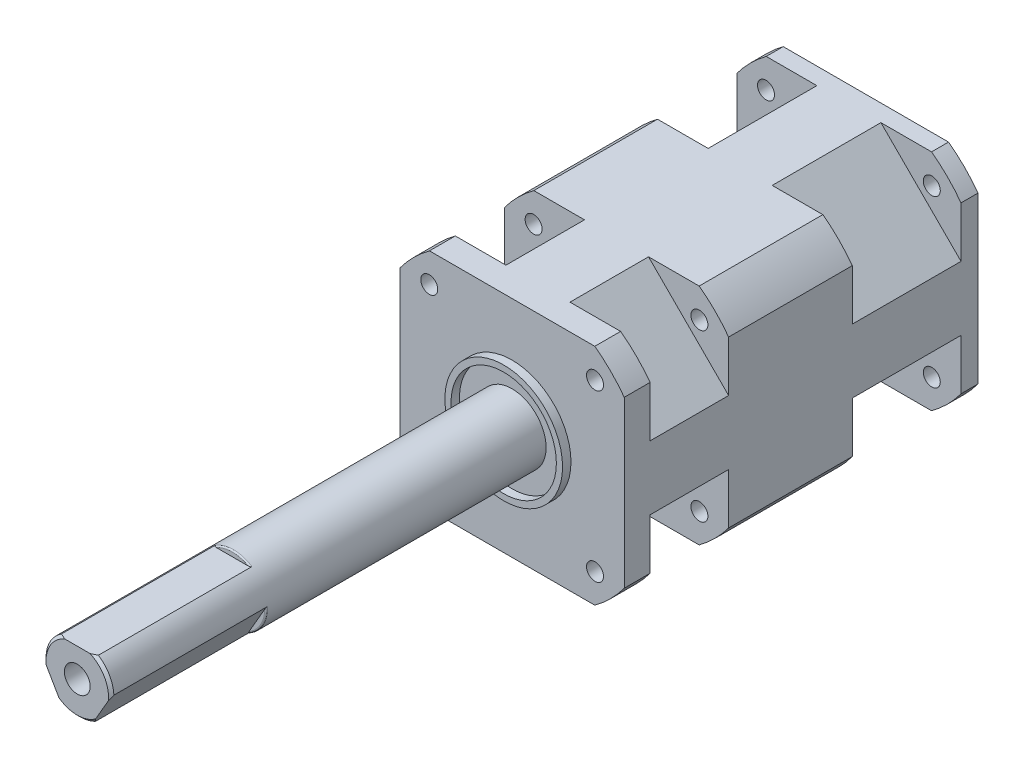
ISO-10303-21;
HEADER;
FILE_DESCRIPTION(('STEP AP214'),'2;1');
FILE_NAME('part.step','',(''),(''),'','','');
FILE_SCHEMA(('AUTOMOTIVE_DESIGN { 1 0 10303 214 1 1 1 1 }'));
ENDSEC;
DATA;
#1=APPLICATION_CONTEXT('core data for automotive mechanical design processes');
#2=APPLICATION_PROTOCOL_DEFINITION('international standard','automotive_design',2000,#1);
#3=PRODUCT_CONTEXT('',#1,'mechanical');
#4=PRODUCT('Part','Part','',(#3));
#5=PRODUCT_RELATED_PRODUCT_CATEGORY('part','',(#4));
#6=PRODUCT_DEFINITION_FORMATION('','',#4);
#7=PRODUCT_DEFINITION_CONTEXT('part definition',#1,'design');
#8=PRODUCT_DEFINITION('design','',#6,#7);
#9=PRODUCT_DEFINITION_SHAPE('','',#8);
#10=(LENGTH_UNIT() NAMED_UNIT(*) SI_UNIT(.MILLI.,.METRE.));
#11=(NAMED_UNIT(*) PLANE_ANGLE_UNIT() SI_UNIT($,.RADIAN.));
#12=(NAMED_UNIT(*) SI_UNIT($,.STERADIAN.) SOLID_ANGLE_UNIT());
#13=UNCERTAINTY_MEASURE_WITH_UNIT(LENGTH_MEASURE(1.E-05),#10,'distance_accuracy_value','');
#14=(GEOMETRIC_REPRESENTATION_CONTEXT(3) GLOBAL_UNCERTAINTY_ASSIGNED_CONTEXT((#13)) GLOBAL_UNIT_ASSIGNED_CONTEXT((#10,
#11,#12)) REPRESENTATION_CONTEXT('',''));
#15=CARTESIAN_POINT('',(0.,0.,0.));
#16=DIRECTION('',(0.,0.,1.));
#17=DIRECTION('',(1.,0.,0.));
#18=AXIS2_PLACEMENT_3D('',#15,#16,#17);
#19=CARTESIAN_POINT('',(1.6306400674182E-12,-3.55618312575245E-13,120.7262));
#20=DIRECTION('',(0.,0.,-1.));
#21=DIRECTION('',(-1.,0.,0.));
#22=AXIS2_PLACEMENT_3D('',#19,#20,#21);
#23=CYLINDRICAL_SURFACE('',#22,6.35);
#24=CARTESIAN_POINT('',(4.64905891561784E-13,0.,39.4462000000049));
#25=DIRECTION('',(0.,0.,1.));
#26=DIRECTION('',(1.,0.,0.));
#27=AXIS2_PLACEMENT_3D('',#24,#25,#26);
#28=CIRCLE('',#27,6.35);
#29=CARTESIAN_POINT('',(6.35000000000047,0.,39.446200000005));
#30=VERTEX_POINT('',#29);
#31=EDGE_CURVE('E780',#30,#30,#28,.T.);
#32=ORIENTED_EDGE('',*,*,#31,.T.);
#33=EDGE_LOOP('',(#32));
#34=FACE_BOUND('',#33,.T.);
#35=DIRECTION('',(0.,0.,-1.));
#36=VECTOR('',#35,1.);
#37=CARTESIAN_POINT('',(-2.8966676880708,-5.65082439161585,120.7262));
#38=LINE('',#37,#36);
#39=CARTESIAN_POINT('',(-2.89666768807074,-5.65082439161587,120.2182));
#40=VERTEX_POINT('',#39);
#41=CARTESIAN_POINT('',(-2.89666768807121,-5.6508243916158,91.5161999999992));
#42=VERTEX_POINT('',#41);
#43=EDGE_CURVE('E930',#40,#42,#38,.T.);
#44=ORIENTED_EDGE('',*,*,#43,.T.);
#45=CARTESIAN_POINT('',(1.23512311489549E-12,-2.53269627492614E-13,91.5162000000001));
#46=DIRECTION('',(0.,0.,-1.));
#47=DIRECTION('',(-1.,0.,0.));
#48=AXIS2_PLACEMENT_3D('',#45,#46,#47);
#49=CIRCLE('',#48,6.35);
#50=CARTESIAN_POINT('',(-6.34209131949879,0.31682439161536,91.5162000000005));
#51=VERTEX_POINT('',#50);
#52=EDGE_CURVE('E960',#42,#51,#49,.T.);
#53=ORIENTED_EDGE('',*,*,#52,.T.);
#54=DIRECTION('',(0.,0.,-1.));
#55=VECTOR('',#54,1.);
#56=CARTESIAN_POINT('',(-6.34209131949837,0.316824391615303,120.7262));
#57=LINE('',#56,#55);
#58=CARTESIAN_POINT('',(-6.34209131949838,0.316824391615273,120.218199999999));
#59=VERTEX_POINT('',#58);
#60=EDGE_CURVE('E947',#51,#59,#57,.F.);
#61=ORIENTED_EDGE('',*,*,#60,.T.);
#62=CARTESIAN_POINT('',(1.66533453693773E-12,-3.53883589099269E-13,120.218199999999));
#63=DIRECTION('',(0.,0.,-1.));
#64=DIRECTION('',(-1.,0.,0.));
#65=AXIS2_PLACEMENT_3D('',#62,#63,#64);
#66=CIRCLE('',#65,6.35);
#67=CARTESIAN_POINT('',(-3.44542363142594,5.33399999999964,120.2182));
#68=VERTEX_POINT('',#67);
#69=EDGE_CURVE('E802',#59,#68,#66,.T.);
#70=ORIENTED_EDGE('',*,*,#69,.T.);
#71=DIRECTION('',(0.,0.,-1.));
#72=VECTOR('',#71,1.);
#73=CARTESIAN_POINT('',(-3.44542363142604,5.33399999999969,120.726200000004));
#74=LINE('',#73,#72);
#75=CARTESIAN_POINT('',(-3.44542363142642,5.33399999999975,91.516200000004));
#76=VERTEX_POINT('',#75);
#77=EDGE_CURVE('E387',#68,#76,#74,.T.);
#78=ORIENTED_EDGE('',*,*,#77,.T.);
#79=CARTESIAN_POINT('',(1.23512311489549E-12,-2.53269627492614E-13,91.5162000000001));
#80=DIRECTION('',(0.,0.,-1.));
#81=DIRECTION('',(-1.,0.,0.));
#82=AXIS2_PLACEMENT_3D('',#79,#80,#81);
#83=CIRCLE('',#82,6.35);
#84=CARTESIAN_POINT('',(3.44542363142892,5.33399999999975,91.5162000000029));
#85=VERTEX_POINT('',#84);
#86=EDGE_CURVE('E953',#76,#85,#83,.T.);
#87=ORIENTED_EDGE('',*,*,#86,.T.);
#88=DIRECTION('',(0.,0.,-1.));
#89=VECTOR('',#88,1.);
#90=CARTESIAN_POINT('',(3.4454236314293,5.33399999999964,120.726200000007));
#91=LINE('',#90,#89);
#92=CARTESIAN_POINT('',(3.44542363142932,5.33399999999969,120.218200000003));
#93=VERTEX_POINT('',#92);
#94=EDGE_CURVE('E381',#85,#93,#91,.F.);
#95=ORIENTED_EDGE('',*,*,#94,.T.);
#96=CARTESIAN_POINT('',(1.66533453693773E-12,-3.53883589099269E-13,120.218199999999));
#97=DIRECTION('',(0.,0.,-1.));
#98=DIRECTION('',(-1.,0.,0.));
#99=AXIS2_PLACEMENT_3D('',#96,#97,#98);
#100=CIRCLE('',#99,6.35);
#101=CARTESIAN_POINT('',(6.34209131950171,0.316824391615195,120.218200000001));
#102=VERTEX_POINT('',#101);
#103=EDGE_CURVE('E805',#93,#102,#100,.T.);
#104=ORIENTED_EDGE('',*,*,#103,.T.);
#105=DIRECTION('',(0.,0.,-1.));
#106=VECTOR('',#105,1.);
#107=CARTESIAN_POINT('',(6.3420913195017,0.316824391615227,120.726200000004));
#108=LINE('',#107,#106);
#109=CARTESIAN_POINT('',(6.34209131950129,0.316824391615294,91.5162000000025));
#110=VERTEX_POINT('',#109);
#111=EDGE_CURVE('E943',#102,#110,#108,.T.);
#112=ORIENTED_EDGE('',*,*,#111,.T.);
#113=CARTESIAN_POINT('',(1.23512311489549E-12,-2.53269627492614E-13,91.5162000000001));
#114=DIRECTION('',(0.,0.,-1.));
#115=DIRECTION('',(-1.,0.,0.));
#116=AXIS2_PLACEMENT_3D('',#113,#114,#115);
#117=CIRCLE('',#116,6.35);
#118=CARTESIAN_POINT('',(2.89666768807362,-5.6508243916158,91.5162000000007));
#119=VERTEX_POINT('',#118);
#120=EDGE_CURVE('E941',#110,#119,#117,.T.);
#121=ORIENTED_EDGE('',*,*,#120,.T.);
#122=DIRECTION('',(0.,0.,-1.));
#123=VECTOR('',#122,1.);
#124=CARTESIAN_POINT('',(2.89666768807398,-5.65082439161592,120.726199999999));
#125=LINE('',#124,#123);
#126=CARTESIAN_POINT('',(2.89666768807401,-5.65082439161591,120.218200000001));
#127=VERTEX_POINT('',#126);
#128=EDGE_CURVE('E938',#119,#127,#125,.F.);
#129=ORIENTED_EDGE('',*,*,#128,.T.);
#130=CARTESIAN_POINT('',(1.66533453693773E-12,-3.53883589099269E-13,120.218199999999));
#131=DIRECTION('',(0.,0.,-1.));
#132=DIRECTION('',(-1.,0.,0.));
#133=AXIS2_PLACEMENT_3D('',#130,#131,#132);
#134=CIRCLE('',#133,6.35);
#135=EDGE_CURVE('E808',#127,#40,#134,.T.);
#136=ORIENTED_EDGE('',*,*,#135,.T.);
#137=EDGE_LOOP('',(#44,#53,#61,#70,#78,#87,#95,#104,#112,#121,#129,#136));
#138=FACE_BOUND('',#137,.T.);
#139=ADVANCED_FACE('F34',(#34,#138),#23,.T.);
#140=CARTESIAN_POINT('',(1.6306400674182E-12,-3.55618312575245E-13,120.7262));
#141=DIRECTION('',(0.,0.,-1.));
#142=DIRECTION('',(-1.,0.,0.));
#143=AXIS2_PLACEMENT_3D('',#140,#141,#142);
#144=PLANE('',#143);
#145=CARTESIAN_POINT('',(1.6306400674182E-12,-3.55618312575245E-13,120.7262));
#146=DIRECTION('',(0.,0.,1.));
#147=DIRECTION('',(1.,0.,0.));
#148=AXIS2_PLACEMENT_3D('',#145,#146,#147);
#149=CIRCLE('',#148,2.41299791);
#150=CARTESIAN_POINT('',(2.41299791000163,-3.53522749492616E-13,120.7262));
#151=VERTEX_POINT('',#150);
#152=EDGE_CURVE('E393',#151,#151,#149,.T.);
#153=ORIENTED_EDGE('',*,*,#152,.F.);
#154=EDGE_LOOP('',(#153));
#155=FACE_BOUND('',#154,.T.);
#156=DIRECTION('',(-0.499999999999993,0.86602540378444,0.));
#157=VECTOR('',#156,1.);
#158=CARTESIAN_POINT('',(-4.61937950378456,-2.6670000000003,120.726200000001));
#159=LINE('',#158,#157);
#160=CARTESIAN_POINT('',(-3.42801390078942,-4.73050575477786,120.726200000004));
#161=VERTEX_POINT('',#160);
#162=CARTESIAN_POINT('',(-5.81074510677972,-0.603494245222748,120.726200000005));
#163=VERTEX_POINT('',#162);
#164=EDGE_CURVE('E796',#161,#163,#159,.T.);
#165=ORIENTED_EDGE('',*,*,#164,.F.);
#166=CARTESIAN_POINT('',(1.6306400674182E-12,-3.55618312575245E-13,120.7262));
#167=DIRECTION('',(0.,0.,-1.));
#168=DIRECTION('',(-1.,0.,0.));
#169=AXIS2_PLACEMENT_3D('',#166,#167,#168);
#170=CIRCLE('',#169,5.842);
#171=CARTESIAN_POINT('',(3.42801390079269,-4.73050575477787,120.726200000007));
#172=VERTEX_POINT('',#171);
#173=EDGE_CURVE('E918',#161,#172,#170,.F.);
#174=ORIENTED_EDGE('',*,*,#173,.T.);
#175=DIRECTION('',(-0.500000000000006,-0.866025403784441,0.));
#176=VECTOR('',#175,1.);
#177=CARTESIAN_POINT('',(4.61937950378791,-2.66700000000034,120.726199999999));
#178=LINE('',#177,#176);
#179=CARTESIAN_POINT('',(5.81074510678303,-0.603494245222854,120.7262));
#180=VERTEX_POINT('',#179);
#181=EDGE_CURVE('E799',#180,#172,#178,.T.);
#182=ORIENTED_EDGE('',*,*,#181,.F.);
#183=CARTESIAN_POINT('',(1.6306400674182E-12,-3.55618312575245E-13,120.7262));
#184=DIRECTION('',(0.,0.,-1.));
#185=DIRECTION('',(-1.,0.,0.));
#186=AXIS2_PLACEMENT_3D('',#183,#184,#185);
#187=CIRCLE('',#186,5.842);
#188=CARTESIAN_POINT('',(2.38273120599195,5.33399999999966,120.726200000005));
#189=VERTEX_POINT('',#188);
#190=EDGE_CURVE('E920',#180,#189,#187,.F.);
#191=ORIENTED_EDGE('',*,*,#190,.T.);
#192=DIRECTION('',(1.,0.,0.));
#193=VECTOR('',#192,1.);
#194=CARTESIAN_POINT('',(1.66186508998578E-12,5.33399999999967,120.726200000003));
#195=LINE('',#194,#193);
#196=CARTESIAN_POINT('',(-2.38273120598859,5.33399999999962,120.726199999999));
#197=VERTEX_POINT('',#196);
#198=EDGE_CURVE('E783',#197,#189,#195,.T.);
#199=ORIENTED_EDGE('',*,*,#198,.F.);
#200=CARTESIAN_POINT('',(1.6306400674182E-12,-3.55618312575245E-13,120.7262));
#201=DIRECTION('',(0.,0.,-1.));
#202=DIRECTION('',(-1.,0.,0.));
#203=AXIS2_PLACEMENT_3D('',#200,#201,#202);
#204=CIRCLE('',#203,5.842);
#205=EDGE_CURVE('E921',#197,#163,#204,.F.);
#206=ORIENTED_EDGE('',*,*,#205,.T.);
#207=EDGE_LOOP('',(#165,#174,#182,#191,#199,#206));
#208=FACE_BOUND('',#207,.T.);
#209=ADVANCED_FACE('F934',(#155,#208),#144,.F.);
#210=CARTESIAN_POINT('',(4.64905891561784E-13,0.,39.4462000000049));
#211=DIRECTION('',(0.,0.,1.));
#212=DIRECTION('',(1.,0.,0.));
#213=AXIS2_PLACEMENT_3D('',#210,#211,#212);
#214=PLANE('',#213);
#215=CARTESIAN_POINT('',(15.4909418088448,15.4909418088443,39.4462));
#216=DIRECTION('',(0.,0.,1.));
#217=DIRECTION('',(1.,0.,0.));
#218=AXIS2_PLACEMENT_3D('',#215,#216,#217);
#219=CIRCLE('',#218,1.5875);
#220=CARTESIAN_POINT('',(17.0784418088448,15.4909418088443,39.4462));
#221=VERTEX_POINT('',#220);
#222=EDGE_CURVE('E441',#221,#221,#219,.F.);
#223=ORIENTED_EDGE('',*,*,#222,.T.);
#224=EDGE_LOOP('',(#223));
#225=FACE_BOUND('',#224,.T.);
#226=CARTESIAN_POINT('',(-15.4909418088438,15.4909418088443,39.4462));
#227=DIRECTION('',(0.,0.,1.));
#228=DIRECTION('',(1.,0.,0.));
#229=AXIS2_PLACEMENT_3D('',#226,#227,#228);
#230=CIRCLE('',#229,1.5875);
#231=CARTESIAN_POINT('',(-13.9034418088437,15.4909418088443,39.4462));
#232=VERTEX_POINT('',#231);
#233=EDGE_CURVE('E457',#232,#232,#230,.T.);
#234=ORIENTED_EDGE('',*,*,#233,.F.);
#235=EDGE_LOOP('',(#234));
#236=FACE_BOUND('',#235,.T.);
#237=CARTESIAN_POINT('',(4.64905891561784E-13,0.,39.4462000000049));
#238=DIRECTION('',(0.,0.,1.));
#239=DIRECTION('',(1.,0.,0.));
#240=AXIS2_PLACEMENT_3D('',#237,#238,#239);
#241=CIRCLE('',#240,26.035);
#242=CARTESIAN_POINT('',(-15.450216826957,20.9549999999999,39.4462));
#243=VERTEX_POINT('',#242);
#244=CARTESIAN_POINT('',(-20.9549999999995,15.4502168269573,39.4461999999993));
#245=VERTEX_POINT('',#244);
#246=EDGE_CURVE('E652',#243,#245,#241,.T.);
#247=ORIENTED_EDGE('',*,*,#246,.T.);
#248=DIRECTION('',(0.,-1.,0.));
#249=VECTOR('',#248,1.);
#250=CARTESIAN_POINT('',(-20.9549999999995,15.4502168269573,39.4461999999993));
#251=LINE('',#250,#249);
#252=CARTESIAN_POINT('',(-20.9549999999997,-15.4502168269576,39.4462));
#253=VERTEX_POINT('',#252);
#254=EDGE_CURVE('E655',#245,#253,#251,.T.);
#255=ORIENTED_EDGE('',*,*,#254,.T.);
#256=CARTESIAN_POINT('',(4.64905891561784E-13,0.,39.4462000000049));
#257=DIRECTION('',(0.,0.,1.));
#258=DIRECTION('',(1.,0.,0.));
#259=AXIS2_PLACEMENT_3D('',#256,#257,#258);
#260=CIRCLE('',#259,26.035);
#261=CARTESIAN_POINT('',(-15.450216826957,-20.955,39.4461999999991));
#262=VERTEX_POINT('',#261);
#263=EDGE_CURVE('E658',#253,#262,#260,.T.);
#264=ORIENTED_EDGE('',*,*,#263,.T.);
#265=DIRECTION('',(1.,0.,0.));
#266=VECTOR('',#265,1.);
#267=CARTESIAN_POINT('',(-15.450216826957,-20.955,39.4461999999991));
#268=LINE('',#267,#266);
#269=CARTESIAN_POINT('',(15.4502168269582,-20.955,39.4462));
#270=VERTEX_POINT('',#269);
#271=EDGE_CURVE('E661',#262,#270,#268,.T.);
#272=ORIENTED_EDGE('',*,*,#271,.T.);
#273=CARTESIAN_POINT('',(4.64905891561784E-13,0.,39.4462000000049));
#274=DIRECTION('',(0.,0.,1.));
#275=DIRECTION('',(1.,0.,0.));
#276=AXIS2_PLACEMENT_3D('',#273,#274,#275);
#277=CIRCLE('',#276,26.035);
#278=CARTESIAN_POINT('',(20.9550000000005,-15.4502168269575,39.4461999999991));
#279=VERTEX_POINT('',#278);
#280=EDGE_CURVE('E664',#270,#279,#277,.T.);
#281=ORIENTED_EDGE('',*,*,#280,.T.);
#282=DIRECTION('',(0.,1.,0.));
#283=VECTOR('',#282,1.);
#284=CARTESIAN_POINT('',(20.9550000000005,-15.4502168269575,39.4461999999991));
#285=LINE('',#284,#283);
#286=CARTESIAN_POINT('',(20.9550000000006,15.4502168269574,39.4461999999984));
#287=VERTEX_POINT('',#286);
#288=EDGE_CURVE('E667',#279,#287,#285,.T.);
#289=ORIENTED_EDGE('',*,*,#288,.T.);
#290=CARTESIAN_POINT('',(4.64905891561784E-13,0.,39.4462000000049));
#291=DIRECTION('',(0.,0.,1.));
#292=DIRECTION('',(1.,0.,0.));
#293=AXIS2_PLACEMENT_3D('',#290,#291,#292);
#294=CIRCLE('',#293,26.035);
#295=CARTESIAN_POINT('',(15.450216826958,20.955,39.446200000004));
#296=VERTEX_POINT('',#295);
#297=EDGE_CURVE('E670',#287,#296,#294,.T.);
#298=ORIENTED_EDGE('',*,*,#297,.T.);
#299=DIRECTION('',(1.,0.,0.));
#300=VECTOR('',#299,1.);
#301=CARTESIAN_POINT('',(-15.450216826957,20.9549999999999,39.4462));
#302=LINE('',#301,#300);
#303=EDGE_CURVE('E673',#243,#296,#302,.T.);
#304=ORIENTED_EDGE('',*,*,#303,.F.);
#305=EDGE_LOOP('',(#247,#255,#264,#272,#281,#289,#298,#304));
#306=FACE_BOUND('',#305,.T.);
#307=CARTESIAN_POINT('',(4.64905891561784E-13,0.,39.4462000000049));
#308=DIRECTION('',(0.,0.,1.));
#309=DIRECTION('',(1.,0.,0.));
#310=AXIS2_PLACEMENT_3D('',#307,#308,#309);
#311=CIRCLE('',#310,10.9982);
#312=CARTESIAN_POINT('',(10.9982000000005,0.,39.446200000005));
#313=VERTEX_POINT('',#312);
#314=EDGE_CURVE('E473',#313,#313,#311,.T.);
#315=ORIENTED_EDGE('',*,*,#314,.F.);
#316=EDGE_LOOP('',(#315));
#317=FACE_BOUND('',#316,.T.);
#318=CARTESIAN_POINT('',(15.4909418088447,-15.4909418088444,39.4462000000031));
#319=DIRECTION('',(0.,0.,1.));
#320=DIRECTION('',(1.,0.,0.));
#321=AXIS2_PLACEMENT_3D('',#318,#319,#320);
#322=CIRCLE('',#321,1.5875);
#323=CARTESIAN_POINT('',(17.0784418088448,-15.4909418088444,39.4462000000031));
#324=VERTEX_POINT('',#323);
#325=EDGE_CURVE('E425',#324,#324,#322,.T.);
#326=ORIENTED_EDGE('',*,*,#325,.F.);
#327=EDGE_LOOP('',(#326));
#328=FACE_BOUND('',#327,.T.);
#329=CARTESIAN_POINT('',(-15.4909418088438,-15.4909418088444,39.4462));
#330=DIRECTION('',(0.,0.,1.));
#331=DIRECTION('',(1.,0.,0.));
#332=AXIS2_PLACEMENT_3D('',#329,#330,#331);
#333=CIRCLE('',#332,1.5875);
#334=CARTESIAN_POINT('',(-13.9034418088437,-15.4909418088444,39.4462));
#335=VERTEX_POINT('',#334);
#336=EDGE_CURVE('E409',#335,#335,#333,.F.);
#337=ORIENTED_EDGE('',*,*,#336,.T.);
#338=EDGE_LOOP('',(#337));
#339=FACE_BOUND('',#338,.T.);
#340=ADVANCED_FACE('F1004',(#225,#236,#306,#317,#328,#339),#214,.T.);
#341=CARTESIAN_POINT('',(-4.30211422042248E-13,0.,-26.67));
#342=DIRECTION('',(0.,0.,-1.));
#343=DIRECTION('',(-1.,0.,0.));
#344=AXIS2_PLACEMENT_3D('',#341,#342,#343);
#345=PLANE('',#344);
#346=CARTESIAN_POINT('',(15.4909418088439,15.4909418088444,-26.6700000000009));
#347=DIRECTION('',(0.,0.,1.));
#348=DIRECTION('',(1.,0.,0.));
#349=AXIS2_PLACEMENT_3D('',#346,#347,#348);
#350=CIRCLE('',#349,1.5875);
#351=CARTESIAN_POINT('',(17.0784418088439,15.4909418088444,-26.6700000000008));
#352=VERTEX_POINT('',#351);
#353=EDGE_CURVE('E428',#352,#352,#350,.T.);
#354=ORIENTED_EDGE('',*,*,#353,.T.);
#355=EDGE_LOOP('',(#354));
#356=FACE_BOUND('',#355,.T.);
#357=CARTESIAN_POINT('',(-15.4909418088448,15.4909418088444,-26.67));
#358=DIRECTION('',(0.,0.,-1.));
#359=DIRECTION('',(-1.,0.,0.));
#360=AXIS2_PLACEMENT_3D('',#357,#358,#359);
#361=CIRCLE('',#360,1.5875);
#362=CARTESIAN_POINT('',(-17.0784418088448,15.4909418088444,-26.67));
#363=VERTEX_POINT('',#362);
#364=EDGE_CURVE('E444',#363,#363,#361,.T.);
#365=ORIENTED_EDGE('',*,*,#364,.F.);
#366=EDGE_LOOP('',(#365));
#367=FACE_BOUND('',#366,.T.);
#368=CARTESIAN_POINT('',(-4.30211422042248E-13,0.,-26.67));
#369=DIRECTION('',(0.,0.,-1.));
#370=DIRECTION('',(-1.,0.,0.));
#371=AXIS2_PLACEMENT_3D('',#368,#369,#370);
#372=CIRCLE('',#371,11.0109);
#373=CARTESIAN_POINT('',(-11.0109000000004,0.,-26.6700000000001));
#374=VERTEX_POINT('',#373);
#375=EDGE_CURVE('E464',#374,#374,#372,.T.);
#376=ORIENTED_EDGE('',*,*,#375,.F.);
#377=EDGE_LOOP('',(#376));
#378=FACE_BOUND('',#377,.T.);
#379=CARTESIAN_POINT('',(-4.30211422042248E-13,0.,-26.67));
#380=DIRECTION('',(0.,0.,-1.));
#381=DIRECTION('',(-1.,0.,0.));
#382=AXIS2_PLACEMENT_3D('',#379,#380,#381);
#383=CIRCLE('',#382,26.035);
#384=CARTESIAN_POINT('',(-20.9550000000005,15.4502168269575,-26.6699999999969));
#385=VERTEX_POINT('',#384);
#386=CARTESIAN_POINT('',(-15.4502168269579,20.955,-26.6700000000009));
#387=VERTEX_POINT('',#386);
#388=EDGE_CURVE('E628',#385,#387,#383,.T.);
#389=ORIENTED_EDGE('',*,*,#388,.T.);
#390=DIRECTION('',(-1.,0.,0.));
#391=VECTOR('',#390,1.);
#392=CARTESIAN_POINT('',(15.4502168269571,20.9550000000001,-26.6700000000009));
#393=LINE('',#392,#391);
#394=CARTESIAN_POINT('',(15.4502168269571,20.9550000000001,-26.6700000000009));
#395=VERTEX_POINT('',#394);
#396=EDGE_CURVE('E631',#395,#387,#393,.T.);
#397=ORIENTED_EDGE('',*,*,#396,.F.);
#398=CARTESIAN_POINT('',(-4.30211422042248E-13,0.,-26.67));
#399=DIRECTION('',(0.,0.,-1.));
#400=DIRECTION('',(-1.,0.,0.));
#401=AXIS2_PLACEMENT_3D('',#398,#399,#400);
#402=CIRCLE('',#401,26.035);
#403=CARTESIAN_POINT('',(20.9549999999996,15.4502168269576,-26.6699999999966));
#404=VERTEX_POINT('',#403);
#405=EDGE_CURVE('E634',#395,#404,#402,.T.);
#406=ORIENTED_EDGE('',*,*,#405,.T.);
#407=DIRECTION('',(0.,-1.,0.));
#408=VECTOR('',#407,1.);
#409=CARTESIAN_POINT('',(20.9549999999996,15.4502168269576,-26.6699999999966));
#410=LINE('',#409,#408);
#411=CARTESIAN_POINT('',(20.9549999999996,-15.4502168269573,-26.6700000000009));
#412=VERTEX_POINT('',#411);
#413=EDGE_CURVE('E637',#404,#412,#410,.T.);
#414=ORIENTED_EDGE('',*,*,#413,.T.);
#415=CARTESIAN_POINT('',(-4.30211422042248E-13,0.,-26.67));
#416=DIRECTION('',(0.,0.,-1.));
#417=DIRECTION('',(-1.,0.,0.));
#418=AXIS2_PLACEMENT_3D('',#415,#416,#417);
#419=CIRCLE('',#418,26.035);
#420=CARTESIAN_POINT('',(15.4502168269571,-20.9549999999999,-26.669999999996));
#421=VERTEX_POINT('',#420);
#422=EDGE_CURVE('E640',#412,#421,#419,.T.);
#423=ORIENTED_EDGE('',*,*,#422,.T.);
#424=DIRECTION('',(1.,0.,0.));
#425=VECTOR('',#424,1.);
#426=CARTESIAN_POINT('',(-15.450216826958,-20.955,-26.6699999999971));
#427=LINE('',#426,#425);
#428=CARTESIAN_POINT('',(-15.450216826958,-20.955,-26.6699999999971));
#429=VERTEX_POINT('',#428);
#430=EDGE_CURVE('E643',#429,#421,#427,.T.);
#431=ORIENTED_EDGE('',*,*,#430,.F.);
#432=CARTESIAN_POINT('',(-4.30211422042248E-13,0.,-26.67));
#433=DIRECTION('',(0.,0.,-1.));
#434=DIRECTION('',(-1.,0.,0.));
#435=AXIS2_PLACEMENT_3D('',#432,#433,#434);
#436=CIRCLE('',#435,26.035);
#437=CARTESIAN_POINT('',(-20.9550000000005,-15.4502168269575,-26.67));
#438=VERTEX_POINT('',#437);
#439=EDGE_CURVE('E646',#429,#438,#436,.T.);
#440=ORIENTED_EDGE('',*,*,#439,.T.);
#441=DIRECTION('',(0.,1.,0.));
#442=VECTOR('',#441,1.);
#443=CARTESIAN_POINT('',(-20.9550000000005,-15.4502168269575,-26.67));
#444=LINE('',#443,#442);
#445=EDGE_CURVE('E649',#438,#385,#444,.T.);
#446=ORIENTED_EDGE('',*,*,#445,.T.);
#447=EDGE_LOOP('',(#389,#397,#406,#414,#423,#431,#440,#446));
#448=FACE_BOUND('',#447,.T.);
#449=CARTESIAN_POINT('',(15.4909418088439,-15.4909418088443,-26.6700000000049));
#450=DIRECTION('',(0.,0.,-1.));
#451=DIRECTION('',(-1.,0.,0.));
#452=AXIS2_PLACEMENT_3D('',#449,#450,#451);
#453=CIRCLE('',#452,1.5875);
#454=CARTESIAN_POINT('',(13.9034418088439,-15.4909418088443,-26.6700000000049));
#455=VERTEX_POINT('',#454);
#456=EDGE_CURVE('E412',#455,#455,#453,.T.);
#457=ORIENTED_EDGE('',*,*,#456,.F.);
#458=EDGE_LOOP('',(#457));
#459=FACE_BOUND('',#458,.T.);
#460=CARTESIAN_POINT('',(-15.4909418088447,-15.4909418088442,-26.6700000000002));
#461=DIRECTION('',(0.,0.,1.));
#462=DIRECTION('',(1.,0.,0.));
#463=AXIS2_PLACEMENT_3D('',#460,#461,#462);
#464=CIRCLE('',#463,1.5875);
#465=CARTESIAN_POINT('',(-13.9034418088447,-15.4909418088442,-26.6700000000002));
#466=VERTEX_POINT('',#465);
#467=EDGE_CURVE('E396',#466,#466,#464,.T.);
#468=ORIENTED_EDGE('',*,*,#467,.T.);
#469=EDGE_LOOP('',(#468));
#470=FACE_BOUND('',#469,.T.);
#471=ADVANCED_FACE('F1093',(#356,#367,#378,#448,#459,#470),#345,.T.);
#472=CARTESIAN_POINT('',(-3.72175071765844,-4.32484208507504,-3.17499999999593));
#473=DIRECTION('',(0.,0.,1.));
#474=DIRECTION('',(1.,0.,0.));
#475=AXIS2_PLACEMENT_3D('',#472,#473,#474);
#476=PLANE('',#475);
#477=DIRECTION('',(0.707106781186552,-0.707106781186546,0.));
#478=VECTOR('',#477,1.);
#479=CARTESIAN_POINT('',(-22.6159262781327,-4.32484208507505,-3.17499999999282));
#480=LINE('',#479,#478);
#481=CARTESIAN_POINT('',(-20.9550000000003,-5.98576836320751,-3.17500000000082));
#482=VERTEX_POINT('',#481);
#483=CARTESIAN_POINT('',(-5.98576836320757,-20.955,-3.17500000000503));
#484=VERTEX_POINT('',#483);
#485=EDGE_CURVE('E574',#482,#484,#480,.T.);
#486=ORIENTED_EDGE('',*,*,#485,.T.);
#487=DIRECTION('',(-1.,0.,0.));
#488=VECTOR('',#487,1.);
#489=CARTESIAN_POINT('',(20.9549999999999,-20.9549999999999,-3.17500000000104));
#490=LINE('',#489,#488);
#491=CARTESIAN_POINT('',(-15.4502168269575,-20.955,-3.17499999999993));
#492=VERTEX_POINT('',#491);
#493=EDGE_CURVE('E582',#484,#492,#490,.T.);
#494=ORIENTED_EDGE('',*,*,#493,.T.);
#495=CARTESIAN_POINT('',(0.,0.,-3.17499999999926));
#496=DIRECTION('',(0.,0.,1.));
#497=DIRECTION('',(1.,0.,0.));
#498=AXIS2_PLACEMENT_3D('',#495,#496,#497);
#499=CIRCLE('',#498,26.035);
#500=CARTESIAN_POINT('',(-20.9550000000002,-15.4502168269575,-3.17499999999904));
#501=VERTEX_POINT('',#500);
#502=EDGE_CURVE('E734',#492,#501,#499,.F.);
#503=ORIENTED_EDGE('',*,*,#502,.T.);
#504=DIRECTION('',(0.,-1.,0.));
#505=VECTOR('',#504,1.);
#506=CARTESIAN_POINT('',(-20.9550000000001,20.9549999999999,-3.1749999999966));
#507=LINE('',#506,#505);
#508=EDGE_CURVE('E585',#482,#501,#507,.T.);
#509=ORIENTED_EDGE('',*,*,#508,.F.);
#510=EDGE_LOOP('',(#486,#494,#503,#509));
#511=FACE_BOUND('',#510,.T.);
#512=CARTESIAN_POINT('',(-15.4909418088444,-15.4909418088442,-3.17499999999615));
#513=DIRECTION('',(0.,0.,1.));
#514=DIRECTION('',(1.,0.,0.));
#515=AXIS2_PLACEMENT_3D('',#512,#513,#514);
#516=CIRCLE('',#515,1.5875);
#517=CARTESIAN_POINT('',(-13.9034418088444,-15.4909418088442,-3.17499999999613));
#518=VERTEX_POINT('',#517);
#519=EDGE_CURVE('E406',#518,#518,#516,.F.);
#520=ORIENTED_EDGE('',*,*,#519,.F.);
#521=EDGE_LOOP('',(#520));
#522=FACE_BOUND('',#521,.T.);
#523=ADVANCED_FACE('F1089',(#511,#522),#476,.F.);
#524=CARTESIAN_POINT('',(-3.72175071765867,-4.32484208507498,-23.4949999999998));
#525=DIRECTION('',(0.,0.,1.));
#526=DIRECTION('',(1.,0.,0.));
#527=AXIS2_PLACEMENT_3D('',#524,#525,#526);
#528=PLANE('',#527);
#529=DIRECTION('',(0.,-1.,0.));
#530=VECTOR('',#529,1.);
#531=CARTESIAN_POINT('',(-20.9550000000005,20.955,-23.4949999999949));
#532=LINE('',#531,#530);
#533=CARTESIAN_POINT('',(-20.9550000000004,-5.98576836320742,-23.494999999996));
#534=VERTEX_POINT('',#533);
#535=CARTESIAN_POINT('',(-20.9550000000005,-15.4502168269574,-23.4949999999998));
#536=VERTEX_POINT('',#535);
#537=EDGE_CURVE('E580',#534,#536,#532,.T.);
#538=ORIENTED_EDGE('',*,*,#537,.T.);
#539=CARTESIAN_POINT('',(-3.50414142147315E-13,0.,-23.495));
#540=DIRECTION('',(0.,0.,1.));
#541=DIRECTION('',(1.,0.,0.));
#542=AXIS2_PLACEMENT_3D('',#539,#540,#541);
#543=CIRCLE('',#542,26.035);
#544=CARTESIAN_POINT('',(-15.4502168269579,-20.955,-23.495));
#545=VERTEX_POINT('',#544);
#546=EDGE_CURVE('E731',#545,#536,#543,.F.);
#547=ORIENTED_EDGE('',*,*,#546,.F.);
#548=DIRECTION('',(-1.,0.,0.));
#549=VECTOR('',#548,1.);
#550=CARTESIAN_POINT('',(20.9549999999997,-20.955,-23.495));
#551=LINE('',#550,#549);
#552=CARTESIAN_POINT('',(-5.98576836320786,-20.955,-23.495000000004));
#553=VERTEX_POINT('',#552);
#554=EDGE_CURVE('E577',#553,#545,#551,.T.);
#555=ORIENTED_EDGE('',*,*,#554,.F.);
#556=DIRECTION('',(0.707106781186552,-0.707106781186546,0.));
#557=VECTOR('',#556,1.);
#558=CARTESIAN_POINT('',(-22.6159262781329,-4.32484208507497,-23.4949999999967));
#559=LINE('',#558,#557);
#560=EDGE_CURVE('E571',#534,#553,#559,.T.);
#561=ORIENTED_EDGE('',*,*,#560,.F.);
#562=EDGE_LOOP('',(#538,#547,#555,#561));
#563=FACE_BOUND('',#562,.T.);
#564=CARTESIAN_POINT('',(-15.4909418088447,-15.4909418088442,-23.495));
#565=DIRECTION('',(0.,0.,1.));
#566=DIRECTION('',(1.,0.,0.));
#567=AXIS2_PLACEMENT_3D('',#564,#565,#566);
#568=CIRCLE('',#567,1.5875);
#569=CARTESIAN_POINT('',(-13.9034418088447,-15.4909418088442,-23.495));
#570=VERTEX_POINT('',#569);
#571=EDGE_CURVE('E403',#570,#570,#568,.F.);
#572=ORIENTED_EDGE('',*,*,#571,.T.);
#573=EDGE_LOOP('',(#572));
#574=FACE_BOUND('',#573,.T.);
#575=ADVANCED_FACE('F1031',(#563,#574),#528,.T.);
#576=CARTESIAN_POINT('',(-31.2477512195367,-10.3280691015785,19.938999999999));
#577=DIRECTION('',(0.,0.,1.));
#578=DIRECTION('',(1.,0.,0.));
#579=AXIS2_PLACEMENT_3D('',#576,#577,#578);
#580=PLANE('',#579);
#581=DIRECTION('',(0.707106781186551,-0.707106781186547,0.));
#582=VECTOR('',#581,1.);
#583=CARTESIAN_POINT('',(-23.9302252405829,-3.01054312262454,19.9390000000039));
#584=LINE('',#583,#582);
#585=CARTESIAN_POINT('',(-20.9549999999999,-5.98576836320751,19.939000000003));
#586=VERTEX_POINT('',#585);
#587=CARTESIAN_POINT('',(-5.9857683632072,-20.955,19.9389999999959));
#588=VERTEX_POINT('',#587);
#589=EDGE_CURVE('E482',#586,#588,#584,.T.);
#590=ORIENTED_EDGE('',*,*,#589,.F.);
#591=DIRECTION('',(0.,-1.,0.));
#592=VECTOR('',#591,1.);
#593=CARTESIAN_POINT('',(-20.9549999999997,20.9549999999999,19.9390000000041));
#594=LINE('',#593,#592);
#595=CARTESIAN_POINT('',(-20.9549999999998,-15.4502168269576,19.9390000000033));
#596=VERTEX_POINT('',#595);
#597=EDGE_CURVE('E490',#586,#596,#594,.T.);
#598=ORIENTED_EDGE('',*,*,#597,.T.);
#599=CARTESIAN_POINT('',(1.80411241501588E-13,0.,19.9390000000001));
#600=DIRECTION('',(0.,0.,1.));
#601=DIRECTION('',(1.,0.,0.));
#602=AXIS2_PLACEMENT_3D('',#599,#600,#601);
#603=CIRCLE('',#602,26.035);
#604=CARTESIAN_POINT('',(-15.4502168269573,-20.9550000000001,19.9390000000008));
#605=VERTEX_POINT('',#604);
#606=EDGE_CURVE('E772',#605,#596,#603,.F.);
#607=ORIENTED_EDGE('',*,*,#606,.F.);
#608=DIRECTION('',(-1.,0.,0.));
#609=VECTOR('',#608,1.);
#610=CARTESIAN_POINT('',(20.9550000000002,-20.9550000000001,19.938999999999));
#611=LINE('',#610,#609);
#612=EDGE_CURVE('E492',#588,#605,#611,.T.);
#613=ORIENTED_EDGE('',*,*,#612,.F.);
#614=EDGE_LOOP('',(#590,#598,#607,#613));
#615=FACE_BOUND('',#614,.T.);
#616=CARTESIAN_POINT('',(-15.490941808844,-15.4909418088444,19.9390000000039));
#617=DIRECTION('',(0.,0.,1.));
#618=DIRECTION('',(1.,0.,0.));
#619=AXIS2_PLACEMENT_3D('',#616,#617,#618);
#620=CIRCLE('',#619,1.5875);
#621=CARTESIAN_POINT('',(-13.903441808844,-15.4909418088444,19.9390000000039));
#622=VERTEX_POINT('',#621);
#623=EDGE_CURVE('E400',#622,#622,#620,.F.);
#624=ORIENTED_EDGE('',*,*,#623,.T.);
#625=EDGE_LOOP('',(#624));
#626=FACE_BOUND('',#625,.T.);
#627=ADVANCED_FACE('F1027',(#615,#626),#580,.T.);
#628=CARTESIAN_POINT('',(-31.2477512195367,-10.3280691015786,34.6202000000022));
#629=DIRECTION('',(0.,0.,1.));
#630=DIRECTION('',(1.,0.,0.));
#631=AXIS2_PLACEMENT_3D('',#628,#629,#630);
#632=PLANE('',#631);
#633=DIRECTION('',(-1.,0.,0.));
#634=VECTOR('',#633,1.);
#635=CARTESIAN_POINT('',(20.9550000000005,-20.9550000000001,34.6202000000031));
#636=LINE('',#635,#634);
#637=CARTESIAN_POINT('',(-5.98576836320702,-20.9550000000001,34.6202));
#638=VERTEX_POINT('',#637);
#639=CARTESIAN_POINT('',(-15.4502168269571,-20.9550000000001,34.6202));
#640=VERTEX_POINT('',#639);
#641=EDGE_CURVE('E488',#638,#640,#636,.T.);
#642=ORIENTED_EDGE('',*,*,#641,.T.);
#643=CARTESIAN_POINT('',(4.64905891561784E-13,-1.2490009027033E-13,34.6202));
#644=DIRECTION('',(0.,0.,1.));
#645=DIRECTION('',(1.,0.,0.));
#646=AXIS2_PLACEMENT_3D('',#643,#644,#645);
#647=CIRCLE('',#646,26.035);
#648=CARTESIAN_POINT('',(-20.9549999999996,-15.4502168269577,34.6202));
#649=VERTEX_POINT('',#648);
#650=EDGE_CURVE('E770',#640,#649,#647,.F.);
#651=ORIENTED_EDGE('',*,*,#650,.T.);
#652=DIRECTION('',(0.,-1.,0.));
#653=VECTOR('',#652,1.);
#654=CARTESIAN_POINT('',(-20.9549999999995,20.9549999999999,34.620200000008));
#655=LINE('',#654,#653);
#656=CARTESIAN_POINT('',(-20.9549999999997,-5.98576836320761,34.6202));
#657=VERTEX_POINT('',#656);
#658=EDGE_CURVE('E485',#657,#649,#655,.T.);
#659=ORIENTED_EDGE('',*,*,#658,.F.);
#660=DIRECTION('',(0.707106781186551,-0.707106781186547,0.));
#661=VECTOR('',#660,1.);
#662=CARTESIAN_POINT('',(-23.9302252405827,-3.01054312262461,34.6202));
#663=LINE('',#662,#661);
#664=EDGE_CURVE('E479',#657,#638,#663,.T.);
#665=ORIENTED_EDGE('',*,*,#664,.T.);
#666=EDGE_LOOP('',(#642,#651,#659,#665));
#667=FACE_BOUND('',#666,.T.);
#668=CARTESIAN_POINT('',(-15.4909418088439,-15.4909418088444,34.6202));
#669=DIRECTION('',(0.,0.,1.));
#670=DIRECTION('',(1.,0.,0.));
#671=AXIS2_PLACEMENT_3D('',#668,#669,#670);
#672=CIRCLE('',#671,1.5875);
#673=CARTESIAN_POINT('',(-13.9034418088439,-15.4909418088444,34.6202));
#674=VERTEX_POINT('',#673);
#675=EDGE_CURVE('E399',#674,#674,#672,.F.);
#676=ORIENTED_EDGE('',*,*,#675,.F.);
#677=EDGE_LOOP('',(#676));
#678=FACE_BOUND('',#677,.T.);
#679=ADVANCED_FACE('F1023',(#667,#678),#632,.F.);
#680=CARTESIAN_POINT('',(31.0177846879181,27.7695737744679,-3.17499999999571));
#681=DIRECTION('',(0.,0.,-1.));
#682=DIRECTION('',(-1.,0.,0.));
#683=AXIS2_PLACEMENT_3D('',#680,#681,#682);
#684=PLANE('',#683);
#685=DIRECTION('',(0.,-1.,0.));
#686=VECTOR('',#685,1.);
#687=CARTESIAN_POINT('',(20.9549999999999,-20.9549999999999,-3.17500000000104));
#688=LINE('',#687,#686);
#689=CARTESIAN_POINT('',(20.955,15.4502168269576,-3.17499999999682));
#690=VERTEX_POINT('',#689);
#691=CARTESIAN_POINT('',(20.9550000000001,5.98576836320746,-3.17499999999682));
#692=VERTEX_POINT('',#691);
#693=EDGE_CURVE('E605',#690,#692,#688,.T.);
#694=ORIENTED_EDGE('',*,*,#693,.T.);
#695=DIRECTION('',(0.707106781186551,-0.707106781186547,0.));
#696=VECTOR('',#695,1.);
#697=CARTESIAN_POINT('',(4.64958359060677,22.2911847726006,-3.17499999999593));
#698=LINE('',#697,#696);
#699=CARTESIAN_POINT('',(5.98576836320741,20.955,-3.17499999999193));
#700=VERTEX_POINT('',#699);
#701=EDGE_CURVE('E594',#700,#692,#698,.T.);
#702=ORIENTED_EDGE('',*,*,#701,.F.);
#703=DIRECTION('',(-1.,0.,0.));
#704=VECTOR('',#703,1.);
#705=CARTESIAN_POINT('',(-20.9550000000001,20.9549999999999,-3.1749999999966));
#706=LINE('',#705,#704);
#707=CARTESIAN_POINT('',(15.4502168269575,20.9550000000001,-3.17499999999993));
#708=VERTEX_POINT('',#707);
#709=EDGE_CURVE('E602',#708,#700,#706,.T.);
#710=ORIENTED_EDGE('',*,*,#709,.F.);
#711=CARTESIAN_POINT('',(0.,0.,-3.17499999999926));
#712=DIRECTION('',(0.,0.,-1.));
#713=DIRECTION('',(-1.,0.,0.));
#714=AXIS2_PLACEMENT_3D('',#711,#712,#713);
#715=CIRCLE('',#714,26.035);
#716=EDGE_CURVE('E725',#690,#708,#715,.F.);
#717=ORIENTED_EDGE('',*,*,#716,.F.);
#718=EDGE_LOOP('',(#694,#702,#710,#717));
#719=FACE_BOUND('',#718,.T.);
#720=CARTESIAN_POINT('',(15.4909418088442,15.4909418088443,-3.17499999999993));
#721=DIRECTION('',(0.,0.,-1.));
#722=DIRECTION('',(-1.,0.,0.));
#723=AXIS2_PLACEMENT_3D('',#720,#721,#722);
#724=CIRCLE('',#723,1.5875);
#725=CARTESIAN_POINT('',(13.9034418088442,15.4909418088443,-3.17499999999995));
#726=VERTEX_POINT('',#725);
#727=EDGE_CURVE('E438',#726,#726,#724,.F.);
#728=ORIENTED_EDGE('',*,*,#727,.T.);
#729=EDGE_LOOP('',(#728));
#730=FACE_BOUND('',#729,.T.);
#731=ADVANCED_FACE('F1026',(#719,#730),#684,.T.);
#732=CARTESIAN_POINT('',(31.0177846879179,27.7695737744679,-23.4949999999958));
#733=DIRECTION('',(0.,0.,-1.));
#734=DIRECTION('',(-1.,0.,0.));
#735=AXIS2_PLACEMENT_3D('',#732,#733,#734);
#736=PLANE('',#735);
#737=CARTESIAN_POINT('',(-3.50414142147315E-13,0.,-23.495));
#738=DIRECTION('',(0.,0.,-1.));
#739=DIRECTION('',(-1.,0.,0.));
#740=AXIS2_PLACEMENT_3D('',#737,#738,#739);
#741=CIRCLE('',#740,26.035);
#742=CARTESIAN_POINT('',(20.9549999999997,15.4502168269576,-23.4949999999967));
#743=VERTEX_POINT('',#742);
#744=CARTESIAN_POINT('',(15.450216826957,20.9550000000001,-23.494999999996));
#745=VERTEX_POINT('',#744);
#746=EDGE_CURVE('E723',#743,#745,#741,.F.);
#747=ORIENTED_EDGE('',*,*,#746,.T.);
#748=DIRECTION('',(-1.,0.,0.));
#749=VECTOR('',#748,1.);
#750=CARTESIAN_POINT('',(-20.9550000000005,20.955,-23.4949999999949));
#751=LINE('',#750,#749);
#752=CARTESIAN_POINT('',(5.98576836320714,20.955,-23.4949999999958));
#753=VERTEX_POINT('',#752);
#754=EDGE_CURVE('E597',#745,#753,#751,.T.);
#755=ORIENTED_EDGE('',*,*,#754,.T.);
#756=DIRECTION('',(0.707106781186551,-0.707106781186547,0.));
#757=VECTOR('',#756,1.);
#758=CARTESIAN_POINT('',(4.6495835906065,22.2911847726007,-23.4949999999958));
#759=LINE('',#758,#757);
#760=CARTESIAN_POINT('',(20.9549999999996,5.98576836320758,-23.4949999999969));
#761=VERTEX_POINT('',#760);
#762=EDGE_CURVE('E591',#753,#761,#759,.T.);
#763=ORIENTED_EDGE('',*,*,#762,.T.);
#764=DIRECTION('',(0.,-1.,0.));
#765=VECTOR('',#764,1.);
#766=CARTESIAN_POINT('',(20.9549999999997,-20.955,-23.495));
#767=LINE('',#766,#765);
#768=EDGE_CURVE('E599',#743,#761,#767,.T.);
#769=ORIENTED_EDGE('',*,*,#768,.F.);
#770=EDGE_LOOP('',(#747,#755,#763,#769));
#771=FACE_BOUND('',#770,.T.);
#772=CARTESIAN_POINT('',(15.490941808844,15.4909418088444,-23.4949999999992));
#773=DIRECTION('',(0.,0.,-1.));
#774=DIRECTION('',(-1.,0.,0.));
#775=AXIS2_PLACEMENT_3D('',#772,#773,#774);
#776=CIRCLE('',#775,1.5875);
#777=CARTESIAN_POINT('',(13.903441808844,15.4909418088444,-23.4949999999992));
#778=VERTEX_POINT('',#777);
#779=EDGE_CURVE('E435',#778,#778,#776,.F.);
#780=ORIENTED_EDGE('',*,*,#779,.F.);
#781=EDGE_LOOP('',(#780));
#782=FACE_BOUND('',#781,.T.);
#783=ADVANCED_FACE('F1045',(#771,#782),#736,.F.);
#784=CARTESIAN_POINT('',(31.2477512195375,10.3280691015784,19.9390000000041));
#785=DIRECTION('',(0.,0.,1.));
#786=DIRECTION('',(1.,0.,0.));
#787=AXIS2_PLACEMENT_3D('',#784,#785,#786);
#788=PLANE('',#787);
#789=DIRECTION('',(0.,1.,0.));
#790=VECTOR('',#789,1.);
#791=CARTESIAN_POINT('',(20.9550000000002,-20.9550000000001,19.938999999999));
#792=LINE('',#791,#790);
#793=CARTESIAN_POINT('',(20.9550000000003,5.98576836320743,19.9389999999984));
#794=VERTEX_POINT('',#793);
#795=CARTESIAN_POINT('',(20.9550000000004,15.4502168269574,19.939000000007));
#796=VERTEX_POINT('',#795);
#797=EDGE_CURVE('E512',#794,#796,#792,.T.);
#798=ORIENTED_EDGE('',*,*,#797,.T.);
#799=CARTESIAN_POINT('',(1.80411241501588E-13,0.,19.9390000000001));
#800=DIRECTION('',(0.,0.,1.));
#801=DIRECTION('',(1.,0.,0.));
#802=AXIS2_PLACEMENT_3D('',#799,#800,#801);
#803=CIRCLE('',#802,26.035);
#804=CARTESIAN_POINT('',(15.4502168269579,20.9550000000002,19.9390000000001));
#805=VERTEX_POINT('',#804);
#806=EDGE_CURVE('E764',#805,#796,#803,.F.);
#807=ORIENTED_EDGE('',*,*,#806,.F.);
#808=DIRECTION('',(1.,0.,0.));
#809=VECTOR('',#808,1.);
#810=CARTESIAN_POINT('',(-20.9549999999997,20.9549999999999,19.9390000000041));
#811=LINE('',#810,#809);
#812=CARTESIAN_POINT('',(5.98576836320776,20.9549999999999,19.9390000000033));
#813=VERTEX_POINT('',#812);
#814=EDGE_CURVE('E509',#813,#805,#811,.T.);
#815=ORIENTED_EDGE('',*,*,#814,.F.);
#816=DIRECTION('',(-0.707106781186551,0.707106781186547,0.));
#817=VECTOR('',#816,1.);
#818=CARTESIAN_POINT('',(23.9302252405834,3.01054312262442,19.9389999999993));
#819=LINE('',#818,#817);
#820=EDGE_CURVE('E501',#794,#813,#819,.T.);
#821=ORIENTED_EDGE('',*,*,#820,.F.);
#822=EDGE_LOOP('',(#798,#807,#815,#821));
#823=FACE_BOUND('',#822,.T.);
#824=CARTESIAN_POINT('',(15.4909418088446,15.4909418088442,19.9389999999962));
#825=DIRECTION('',(0.,0.,1.));
#826=DIRECTION('',(1.,0.,0.));
#827=AXIS2_PLACEMENT_3D('',#824,#825,#826);
#828=CIRCLE('',#827,1.5875);
#829=CARTESIAN_POINT('',(17.0784418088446,15.4909418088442,19.9389999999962));
#830=VERTEX_POINT('',#829);
#831=EDGE_CURVE('E432',#830,#830,#828,.F.);
#832=ORIENTED_EDGE('',*,*,#831,.T.);
#833=EDGE_LOOP('',(#832));
#834=FACE_BOUND('',#833,.T.);
#835=ADVANCED_FACE('F1041',(#823,#834),#788,.T.);
#836=CARTESIAN_POINT('',(31.2477512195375,10.3280691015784,34.6202000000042));
#837=DIRECTION('',(0.,0.,1.));
#838=DIRECTION('',(1.,0.,0.));
#839=AXIS2_PLACEMENT_3D('',#836,#837,#838);
#840=PLANE('',#839);
#841=DIRECTION('',(-0.707106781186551,0.707106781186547,0.));
#842=VECTOR('',#841,1.);
#843=CARTESIAN_POINT('',(23.9302252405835,3.0105431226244,34.6202));
#844=LINE('',#843,#842);
#845=CARTESIAN_POINT('',(20.9550000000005,5.98576836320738,34.6202000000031));
#846=VERTEX_POINT('',#845);
#847=CARTESIAN_POINT('',(5.98576836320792,20.9549999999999,34.6201999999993));
#848=VERTEX_POINT('',#847);
#849=EDGE_CURVE('E498',#846,#848,#844,.T.);
#850=ORIENTED_EDGE('',*,*,#849,.T.);
#851=DIRECTION('',(1.,0.,0.));
#852=VECTOR('',#851,1.);
#853=CARTESIAN_POINT('',(-20.9549999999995,20.9549999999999,34.620200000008));
#854=LINE('',#853,#852);
#855=CARTESIAN_POINT('',(15.4502168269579,20.955,34.6201999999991));
#856=VERTEX_POINT('',#855);
#857=EDGE_CURVE('E504',#848,#856,#854,.T.);
#858=ORIENTED_EDGE('',*,*,#857,.T.);
#859=CARTESIAN_POINT('',(4.64905891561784E-13,-1.2490009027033E-13,34.6202));
#860=DIRECTION('',(0.,0.,1.));
#861=DIRECTION('',(1.,0.,0.));
#862=AXIS2_PLACEMENT_3D('',#859,#860,#861);
#863=CIRCLE('',#862,26.035);
#864=CARTESIAN_POINT('',(20.9550000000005,15.4502168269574,34.6202000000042));
#865=VERTEX_POINT('',#864);
#866=EDGE_CURVE('E762',#856,#865,#863,.F.);
#867=ORIENTED_EDGE('',*,*,#866,.T.);
#868=DIRECTION('',(0.,1.,0.));
#869=VECTOR('',#868,1.);
#870=CARTESIAN_POINT('',(20.9550000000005,-20.9550000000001,34.6202000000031));
#871=LINE('',#870,#869);
#872=EDGE_CURVE('E506',#846,#865,#871,.T.);
#873=ORIENTED_EDGE('',*,*,#872,.F.);
#874=EDGE_LOOP('',(#850,#858,#867,#873));
#875=FACE_BOUND('',#874,.T.);
#876=CARTESIAN_POINT('',(15.4909418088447,15.4909418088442,34.620200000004));
#877=DIRECTION('',(0.,0.,1.));
#878=DIRECTION('',(1.,0.,0.));
#879=AXIS2_PLACEMENT_3D('',#876,#877,#878);
#880=CIRCLE('',#879,1.5875);
#881=CARTESIAN_POINT('',(17.0784418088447,15.4909418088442,34.620200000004));
#882=VERTEX_POINT('',#881);
#883=EDGE_CURVE('E431',#882,#882,#880,.F.);
#884=ORIENTED_EDGE('',*,*,#883,.F.);
#885=EDGE_LOOP('',(#884));
#886=FACE_BOUND('',#885,.T.);
#887=ADVANCED_FACE('F1037',(#875,#886),#840,.F.);
#888=CARTESIAN_POINT('',(20.9550000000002,-20.955,15.113000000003));
#889=DIRECTION('',(0.,-1.,0.));
#890=DIRECTION('',(0.,0.,-1.));
#891=AXIS2_PLACEMENT_3D('',#888,#889,#890);
#892=PLANE('',#891);
#893=DIRECTION('',(0.,0.,-1.));
#894=VECTOR('',#893,1.);
#895=CARTESIAN_POINT('',(-5.98576836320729,-20.9550000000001,15.1129999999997));
#896=LINE('',#895,#894);
#897=EDGE_CURVE('E495',#638,#588,#896,.T.);
#898=ORIENTED_EDGE('',*,*,#897,.T.);
#899=ORIENTED_EDGE('',*,*,#612,.T.);
#900=DIRECTION('',(0.,0.,1.));
#901=VECTOR('',#900,1.);
#902=CARTESIAN_POINT('',(-15.4502168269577,-20.955,0.));
#903=LINE('',#902,#901);
#904=EDGE_CURVE('E701',#605,#492,#903,.F.);
#905=ORIENTED_EDGE('',*,*,#904,.T.);
#906=ORIENTED_EDGE('',*,*,#493,.F.);
#907=DIRECTION('',(0.,0.,1.));
#908=VECTOR('',#907,1.);
#909=CARTESIAN_POINT('',(-5.98576836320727,-20.9550000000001,15.1129999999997));
#910=LINE('',#909,#908);
#911=EDGE_CURVE('E737',#553,#484,#910,.T.);
#912=ORIENTED_EDGE('',*,*,#911,.F.);
#913=ORIENTED_EDGE('',*,*,#554,.T.);
#914=EDGE_CURVE('E695',#545,#429,#903,.F.);
#915=ORIENTED_EDGE('',*,*,#914,.T.);
#916=ORIENTED_EDGE('',*,*,#430,.T.);
#917=DIRECTION('',(0.,0.,1.));
#918=VECTOR('',#917,1.);
#919=CARTESIAN_POINT('',(15.4502168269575,-20.9549999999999,3.99680288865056E-12));
#920=LINE('',#919,#918);
#921=CARTESIAN_POINT('',(15.4502168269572,-20.9549999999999,-23.494999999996));
#922=VERTEX_POINT('',#921);
#923=EDGE_CURVE('E702',#421,#922,#920,.T.);
#924=ORIENTED_EDGE('',*,*,#923,.T.);
#925=DIRECTION('',(1.,0.,0.));
#926=VECTOR('',#925,1.);
#927=CARTESIAN_POINT('',(20.9549999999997,-20.955,-23.495));
#928=LINE('',#927,#926);
#929=CARTESIAN_POINT('',(5.98576836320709,-20.955,-23.494999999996));
#930=VERTEX_POINT('',#929);
#931=EDGE_CURVE('E559',#930,#922,#928,.T.);
#932=ORIENTED_EDGE('',*,*,#931,.F.);
#933=DIRECTION('',(0.,0.,1.));
#934=VECTOR('',#933,1.);
#935=CARTESIAN_POINT('',(5.98576836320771,-20.955,15.1129999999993));
#936=LINE('',#935,#934);
#937=CARTESIAN_POINT('',(5.98576836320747,-20.955,-3.17499999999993));
#938=VERTEX_POINT('',#937);
#939=EDGE_CURVE('E744',#930,#938,#936,.T.);
#940=ORIENTED_EDGE('',*,*,#939,.T.);
#941=DIRECTION('',(1.,0.,0.));
#942=VECTOR('',#941,1.);
#943=CARTESIAN_POINT('',(20.9549999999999,-20.9549999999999,-3.17500000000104));
#944=LINE('',#943,#942);
#945=CARTESIAN_POINT('',(15.4502168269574,-20.9549999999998,-3.17499999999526));
#946=VERTEX_POINT('',#945);
#947=EDGE_CURVE('E564',#938,#946,#944,.T.);
#948=ORIENTED_EDGE('',*,*,#947,.T.);
#949=CARTESIAN_POINT('',(15.4502168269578,-20.9549999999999,19.9390000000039));
#950=VERTEX_POINT('',#949);
#951=EDGE_CURVE('E706',#946,#950,#920,.T.);
#952=ORIENTED_EDGE('',*,*,#951,.T.);
#953=DIRECTION('',(-1.,0.,0.));
#954=VECTOR('',#953,1.);
#955=CARTESIAN_POINT('',(20.9550000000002,-20.9550000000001,19.938999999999));
#956=LINE('',#955,#954);
#957=CARTESIAN_POINT('',(5.98576836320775,-20.955,19.9389999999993));
#958=VERTEX_POINT('',#957);
#959=EDGE_CURVE('E527',#950,#958,#956,.T.);
#960=ORIENTED_EDGE('',*,*,#959,.T.);
#961=DIRECTION('',(0.,0.,1.));
#962=VECTOR('',#961,1.);
#963=CARTESIAN_POINT('',(5.98576836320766,-20.955,15.1129999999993));
#964=LINE('',#963,#962);
#965=CARTESIAN_POINT('',(5.98576836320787,-20.9550000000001,34.620200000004));
#966=VERTEX_POINT('',#965);
#967=EDGE_CURVE('E759',#958,#966,#964,.T.);
#968=ORIENTED_EDGE('',*,*,#967,.T.);
#969=DIRECTION('',(-1.,0.,0.));
#970=VECTOR('',#969,1.);
#971=CARTESIAN_POINT('',(20.9550000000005,-20.9550000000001,34.6202000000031));
#972=LINE('',#971,#970);
#973=CARTESIAN_POINT('',(15.4502168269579,-20.955,34.6202));
#974=VERTEX_POINT('',#973);
#975=EDGE_CURVE('E522',#974,#966,#972,.T.);
#976=ORIENTED_EDGE('',*,*,#975,.F.);
#977=EDGE_CURVE('E700',#974,#270,#920,.T.);
#978=ORIENTED_EDGE('',*,*,#977,.T.);
#979=ORIENTED_EDGE('',*,*,#271,.F.);
#980=EDGE_CURVE('E697',#262,#640,#903,.F.);
#981=ORIENTED_EDGE('',*,*,#980,.T.);
#982=ORIENTED_EDGE('',*,*,#641,.F.);
#983=EDGE_LOOP('',(#898,#899,#905,#906,#912,#913,#915,#916,#924,#932,#940,#948,#952,#960,#968,
#976,#978,#979,#981,#982));
#984=FACE_BOUND('',#983,.T.);
#985=ADVANCED_FACE('F1040',(#984),#892,.T.);
#986=CARTESIAN_POINT('',(-20.9549999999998,20.9549999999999,15.1130000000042));
#987=DIRECTION('',(1.,0.,0.));
#988=DIRECTION('',(0.,1.,0.));
#989=AXIS2_PLACEMENT_3D('',#986,#987,#988);
#990=PLANE('',#989);
#991=ORIENTED_EDGE('',*,*,#597,.F.);
#992=DIRECTION('',(0.,0.,-1.));
#993=VECTOR('',#992,1.);
#994=CARTESIAN_POINT('',(-20.9549999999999,-5.98576836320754,15.1130000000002));
#995=LINE('',#994,#993);
#996=EDGE_CURVE('E775',#657,#586,#995,.T.);
#997=ORIENTED_EDGE('',*,*,#996,.F.);
#998=ORIENTED_EDGE('',*,*,#658,.T.);
#999=DIRECTION('',(0.,0.,1.));
#1000=VECTOR('',#999,1.);
#1001=CARTESIAN_POINT('',(-20.9550000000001,-15.4502168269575,3.99680288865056E-12));
#1002=LINE('',#1001,#1000);
#1003=EDGE_CURVE('E707',#253,#649,#1002,.F.);
#1004=ORIENTED_EDGE('',*,*,#1003,.F.);
#1005=ORIENTED_EDGE('',*,*,#254,.F.);
#1006=DIRECTION('',(0.,0.,1.));
#1007=VECTOR('',#1006,1.);
#1008=CARTESIAN_POINT('',(-20.9550000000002,15.4502168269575,8.21565038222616E-12));
#1009=LINE('',#1008,#1007);
#1010=CARTESIAN_POINT('',(-20.9549999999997,15.4502168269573,34.6202000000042));
#1011=VERTEX_POINT('',#1010);
#1012=EDGE_CURVE('E710',#1011,#245,#1009,.T.);
#1013=ORIENTED_EDGE('',*,*,#1012,.F.);
#1014=DIRECTION('',(0.,-1.,0.));
#1015=VECTOR('',#1014,1.);
#1016=CARTESIAN_POINT('',(-20.9549999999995,20.9549999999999,34.620200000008));
#1017=LINE('',#1016,#1015);
#1018=CARTESIAN_POINT('',(-20.9549999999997,5.98576836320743,34.6202));
#1019=VERTEX_POINT('',#1018);
#1020=EDGE_CURVE('E540',#1011,#1019,#1017,.T.);
#1021=ORIENTED_EDGE('',*,*,#1020,.T.);
#1022=DIRECTION('',(0.,0.,1.));
#1023=VECTOR('',#1022,1.);
#1024=CARTESIAN_POINT('',(-20.9549999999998,5.9857683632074,15.1130000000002));
#1025=LINE('',#1024,#1023);
#1026=CARTESIAN_POINT('',(-20.9549999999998,5.98576836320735,19.9389999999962));
#1027=VERTEX_POINT('',#1026);
#1028=EDGE_CURVE('E752',#1027,#1019,#1025,.T.);
#1029=ORIENTED_EDGE('',*,*,#1028,.F.);
#1030=DIRECTION('',(0.,-1.,0.));
#1031=VECTOR('',#1030,1.);
#1032=CARTESIAN_POINT('',(-20.9549999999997,20.9549999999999,19.9390000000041));
#1033=LINE('',#1032,#1031);
#1034=CARTESIAN_POINT('',(-20.9549999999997,15.4502168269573,19.939000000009));
#1035=VERTEX_POINT('',#1034);
#1036=EDGE_CURVE('E545',#1035,#1027,#1033,.T.);
#1037=ORIENTED_EDGE('',*,*,#1036,.F.);
#1038=CARTESIAN_POINT('',(-20.9550000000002,15.4502168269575,-3.17499999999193));
#1039=VERTEX_POINT('',#1038);
#1040=EDGE_CURVE('E716',#1039,#1035,#1009,.T.);
#1041=ORIENTED_EDGE('',*,*,#1040,.F.);
#1042=DIRECTION('',(0.,-1.,0.));
#1043=VECTOR('',#1042,1.);
#1044=CARTESIAN_POINT('',(-20.9550000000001,20.9549999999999,-3.1749999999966));
#1045=LINE('',#1044,#1043);
#1046=CARTESIAN_POINT('',(-20.9550000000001,5.98576836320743,-3.17499999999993));
#1047=VERTEX_POINT('',#1046);
#1048=EDGE_CURVE('E622',#1039,#1047,#1045,.T.);
#1049=ORIENTED_EDGE('',*,*,#1048,.T.);
#1050=DIRECTION('',(0.,0.,-1.));
#1051=VECTOR('',#1050,1.);
#1052=CARTESIAN_POINT('',(-20.9549999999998,5.98576836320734,15.1130000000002));
#1053=LINE('',#1052,#1051);
#1054=CARTESIAN_POINT('',(-20.9550000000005,5.98576836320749,-23.495));
#1055=VERTEX_POINT('',#1054);
#1056=EDGE_CURVE('E625',#1047,#1055,#1053,.T.);
#1057=ORIENTED_EDGE('',*,*,#1056,.T.);
#1058=DIRECTION('',(0.,-1.,0.));
#1059=VECTOR('',#1058,1.);
#1060=CARTESIAN_POINT('',(-20.9550000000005,20.955,-23.4949999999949));
#1061=LINE('',#1060,#1059);
#1062=CARTESIAN_POINT('',(-20.9550000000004,15.4502168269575,-23.4949999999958));
#1063=VERTEX_POINT('',#1062);
#1064=EDGE_CURVE('E618',#1063,#1055,#1061,.T.);
#1065=ORIENTED_EDGE('',*,*,#1064,.F.);
#1066=EDGE_CURVE('E712',#385,#1063,#1009,.T.);
#1067=ORIENTED_EDGE('',*,*,#1066,.F.);
#1068=ORIENTED_EDGE('',*,*,#445,.F.);
#1069=EDGE_CURVE('E705',#536,#438,#1002,.F.);
#1070=ORIENTED_EDGE('',*,*,#1069,.F.);
#1071=ORIENTED_EDGE('',*,*,#537,.F.);
#1072=DIRECTION('',(0.,0.,1.));
#1073=VECTOR('',#1072,1.);
#1074=CARTESIAN_POINT('',(-20.9549999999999,-5.98576836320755,15.1130000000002));
#1075=LINE('',#1074,#1073);
#1076=EDGE_CURVE('E588',#534,#482,#1075,.T.);
#1077=ORIENTED_EDGE('',*,*,#1076,.T.);
#1078=ORIENTED_EDGE('',*,*,#508,.T.);
#1079=EDGE_CURVE('E711',#596,#501,#1002,.F.);
#1080=ORIENTED_EDGE('',*,*,#1079,.F.);
#1081=EDGE_LOOP('',(#991,#997,#998,#1004,#1005,#1013,#1021,#1029,#1037,#1041,#1049,#1057,#1065,
#1067,#1068,#1070,#1071,#1077,#1078,#1080));
#1082=FACE_BOUND('',#1081,.T.);
#1083=ADVANCED_FACE('F36',(#1082),#990,.F.);
#1084=CARTESIAN_POINT('',(0.,0.,0.));
#1085=DIRECTION('',(0.,0.,1.));
#1086=DIRECTION('',(1.,0.,0.));
#1087=AXIS2_PLACEMENT_3D('',#1084,#1085,#1086);
#1088=CYLINDRICAL_SURFACE('',#1087,26.035);
#1089=ORIENTED_EDGE('',*,*,#904,.F.);
#1090=ORIENTED_EDGE('',*,*,#606,.T.);
#1091=ORIENTED_EDGE('',*,*,#1079,.T.);
#1092=ORIENTED_EDGE('',*,*,#502,.F.);
#1093=EDGE_LOOP('',(#1089,#1090,#1091,#1092));
#1094=FACE_BOUND('',#1093,.T.);
#1095=ADVANCED_FACE('F1132',(#1094),#1088,.T.);
#1096=CARTESIAN_POINT('',(20.9550000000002,-20.955,15.113000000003));
#1097=DIRECTION('',(-1.,0.,0.));
#1098=DIRECTION('',(0.,-1.,0.));
#1099=AXIS2_PLACEMENT_3D('',#1096,#1097,#1098);
#1100=PLANE('',#1099);
#1101=ORIENTED_EDGE('',*,*,#797,.F.);
#1102=DIRECTION('',(0.,0.,-1.));
#1103=VECTOR('',#1102,1.);
#1104=CARTESIAN_POINT('',(20.9550000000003,5.9857683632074,15.1130000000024));
#1105=LINE('',#1104,#1103);
#1106=EDGE_CURVE('E514',#846,#794,#1105,.T.);
#1107=ORIENTED_EDGE('',*,*,#1106,.F.);
#1108=ORIENTED_EDGE('',*,*,#872,.T.);
#1109=DIRECTION('',(0.,0.,1.));
#1110=VECTOR('',#1109,1.);
#1111=CARTESIAN_POINT('',(20.955,15.4502168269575,7.105427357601E-12));
#1112=LINE('',#1111,#1110);
#1113=EDGE_CURVE('E687',#287,#865,#1112,.F.);
#1114=ORIENTED_EDGE('',*,*,#1113,.F.);
#1115=ORIENTED_EDGE('',*,*,#288,.F.);
#1116=DIRECTION('',(0.,0.,1.));
#1117=VECTOR('',#1116,1.);
#1118=CARTESIAN_POINT('',(20.9550000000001,-15.4502168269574,-8.88178419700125E-13));
#1119=LINE('',#1118,#1117);
#1120=CARTESIAN_POINT('',(20.9550000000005,-15.4502168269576,34.6201999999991));
#1121=VERTEX_POINT('',#1120);
#1122=EDGE_CURVE('E690',#1121,#279,#1119,.T.);
#1123=ORIENTED_EDGE('',*,*,#1122,.F.);
#1124=DIRECTION('',(0.,1.,0.));
#1125=VECTOR('',#1124,1.);
#1126=CARTESIAN_POINT('',(20.9550000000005,-20.9550000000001,34.6202000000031));
#1127=LINE('',#1126,#1125);
#1128=CARTESIAN_POINT('',(20.9550000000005,-5.98576836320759,34.6202000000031));
#1129=VERTEX_POINT('',#1128);
#1130=EDGE_CURVE('E524',#1121,#1129,#1127,.T.);
#1131=ORIENTED_EDGE('',*,*,#1130,.T.);
#1132=DIRECTION('',(0.,0.,1.));
#1133=VECTOR('',#1132,1.);
#1134=CARTESIAN_POINT('',(20.9550000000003,-5.98576836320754,15.1130000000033));
#1135=LINE('',#1134,#1133);
#1136=CARTESIAN_POINT('',(20.9550000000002,-5.98576836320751,19.939000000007));
#1137=VERTEX_POINT('',#1136);
#1138=EDGE_CURVE('E532',#1137,#1129,#1135,.T.);
#1139=ORIENTED_EDGE('',*,*,#1138,.F.);
#1140=DIRECTION('',(0.,1.,0.));
#1141=VECTOR('',#1140,1.);
#1142=CARTESIAN_POINT('',(20.9550000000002,-20.9550000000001,19.938999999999));
#1143=LINE('',#1142,#1141);
#1144=CARTESIAN_POINT('',(20.9550000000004,-15.4502168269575,19.938999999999));
#1145=VERTEX_POINT('',#1144);
#1146=EDGE_CURVE('E530',#1145,#1137,#1143,.T.);
#1147=ORIENTED_EDGE('',*,*,#1146,.F.);
#1148=CARTESIAN_POINT('',(20.955,-15.4502168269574,-3.17500000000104));
#1149=VERTEX_POINT('',#1148);
#1150=EDGE_CURVE('E696',#1149,#1145,#1119,.T.);
#1151=ORIENTED_EDGE('',*,*,#1150,.F.);
#1152=DIRECTION('',(0.,-1.,0.));
#1153=VECTOR('',#1152,1.);
#1154=CARTESIAN_POINT('',(20.9549999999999,-20.9549999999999,-3.17500000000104));
#1155=LINE('',#1154,#1153);
#1156=CARTESIAN_POINT('',(20.9549999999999,-5.98576836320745,-3.17499999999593));
#1157=VERTEX_POINT('',#1156);
#1158=EDGE_CURVE('E567',#1157,#1149,#1155,.T.);
#1159=ORIENTED_EDGE('',*,*,#1158,.F.);
#1160=DIRECTION('',(0.,0.,1.));
#1161=VECTOR('',#1160,1.);
#1162=CARTESIAN_POINT('',(20.9550000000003,-5.98576836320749,15.1130000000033));
#1163=LINE('',#1162,#1161);
#1164=CARTESIAN_POINT('',(20.9549999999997,-5.98576836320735,-23.4949999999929));
#1165=VERTEX_POINT('',#1164);
#1166=EDGE_CURVE('E569',#1165,#1157,#1163,.T.);
#1167=ORIENTED_EDGE('',*,*,#1166,.F.);
#1168=DIRECTION('',(0.,-1.,0.));
#1169=VECTOR('',#1168,1.);
#1170=CARTESIAN_POINT('',(20.9549999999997,-20.955,-23.495));
#1171=LINE('',#1170,#1169);
#1172=CARTESIAN_POINT('',(20.9549999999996,-15.4502168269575,-23.4950000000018));
#1173=VERTEX_POINT('',#1172);
#1174=EDGE_CURVE('E561',#1165,#1173,#1171,.T.);
#1175=ORIENTED_EDGE('',*,*,#1174,.T.);
#1176=EDGE_CURVE('E692',#412,#1173,#1119,.T.);
#1177=ORIENTED_EDGE('',*,*,#1176,.F.);
#1178=ORIENTED_EDGE('',*,*,#413,.F.);
#1179=EDGE_CURVE('E685',#743,#404,#1112,.F.);
#1180=ORIENTED_EDGE('',*,*,#1179,.F.);
#1181=ORIENTED_EDGE('',*,*,#768,.T.);
#1182=DIRECTION('',(0.,0.,-1.));
#1183=VECTOR('',#1182,1.);
#1184=CARTESIAN_POINT('',(20.9550000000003,5.98576836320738,15.1130000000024));
#1185=LINE('',#1184,#1183);
#1186=EDGE_CURVE('E607',#692,#761,#1185,.T.);
#1187=ORIENTED_EDGE('',*,*,#1186,.F.);
#1188=ORIENTED_EDGE('',*,*,#693,.F.);
#1189=EDGE_CURVE('E691',#796,#690,#1112,.F.);
#1190=ORIENTED_EDGE('',*,*,#1189,.F.);
#1191=EDGE_LOOP('',(#1101,#1107,#1108,#1114,#1115,#1123,#1131,#1139,#1147,#1151,#1159,#1167,
#1175,#1177,#1178,#1180,#1181,#1187,#1188,#1190));
#1192=FACE_BOUND('',#1191,.T.);
#1193=ADVANCED_FACE('F1137',(#1192),#1100,.F.);
#1194=CARTESIAN_POINT('',(-20.9549999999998,20.9549999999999,15.1130000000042));
#1195=DIRECTION('',(0.,1.,0.));
#1196=DIRECTION('',(0.,0.,1.));
#1197=AXIS2_PLACEMENT_3D('',#1194,#1195,#1196);
#1198=PLANE('',#1197);
#1199=DIRECTION('',(0.,0.,-1.));
#1200=VECTOR('',#1199,1.);
#1201=CARTESIAN_POINT('',(5.98576836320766,20.9549999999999,15.113000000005));
#1202=LINE('',#1201,#1200);
#1203=EDGE_CURVE('E767',#848,#813,#1202,.T.);
#1204=ORIENTED_EDGE('',*,*,#1203,.T.);
#1205=ORIENTED_EDGE('',*,*,#814,.T.);
#1206=DIRECTION('',(0.,0.,1.));
#1207=VECTOR('',#1206,1.);
#1208=CARTESIAN_POINT('',(15.4502168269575,20.9550000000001,0.));
#1209=LINE('',#1208,#1207);
#1210=EDGE_CURVE('E681',#805,#708,#1209,.F.);
#1211=ORIENTED_EDGE('',*,*,#1210,.T.);
#1212=ORIENTED_EDGE('',*,*,#709,.T.);
#1213=DIRECTION('',(0.,0.,-1.));
#1214=VECTOR('',#1213,1.);
#1215=CARTESIAN_POINT('',(5.98576836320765,20.9549999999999,15.113000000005));
#1216=LINE('',#1215,#1214);
#1217=EDGE_CURVE('E728',#700,#753,#1216,.T.);
#1218=ORIENTED_EDGE('',*,*,#1217,.T.);
#1219=ORIENTED_EDGE('',*,*,#754,.F.);
#1220=EDGE_CURVE('E676',#745,#395,#1209,.F.);
#1221=ORIENTED_EDGE('',*,*,#1220,.T.);
#1222=ORIENTED_EDGE('',*,*,#396,.T.);
#1223=DIRECTION('',(0.,0.,1.));
#1224=VECTOR('',#1223,1.);
#1225=CARTESIAN_POINT('',(-15.4502168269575,20.955,0.));
#1226=LINE('',#1225,#1224);
#1227=CARTESIAN_POINT('',(-15.4502168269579,20.9549999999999,-23.494999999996));
#1228=VERTEX_POINT('',#1227);
#1229=EDGE_CURVE('E682',#387,#1228,#1226,.T.);
#1230=ORIENTED_EDGE('',*,*,#1229,.T.);
#1231=DIRECTION('',(1.,0.,0.));
#1232=VECTOR('',#1231,1.);
#1233=CARTESIAN_POINT('',(-20.9550000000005,20.955,-23.4949999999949));
#1234=LINE('',#1233,#1232);
#1235=CARTESIAN_POINT('',(-5.98576836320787,20.955,-23.495));
#1236=VERTEX_POINT('',#1235);
#1237=EDGE_CURVE('E615',#1228,#1236,#1234,.T.);
#1238=ORIENTED_EDGE('',*,*,#1237,.T.);
#1239=DIRECTION('',(0.,0.,-1.));
#1240=VECTOR('',#1239,1.);
#1241=CARTESIAN_POINT('',(-5.98576836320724,20.9549999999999,15.1129999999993));
#1242=LINE('',#1241,#1240);
#1243=CARTESIAN_POINT('',(-5.98576836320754,20.9549999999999,-3.17500000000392));
#1244=VERTEX_POINT('',#1243);
#1245=EDGE_CURVE('E721',#1244,#1236,#1242,.T.);
#1246=ORIENTED_EDGE('',*,*,#1245,.F.);
#1247=DIRECTION('',(1.,0.,0.));
#1248=VECTOR('',#1247,1.);
#1249=CARTESIAN_POINT('',(-20.9550000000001,20.9549999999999,-3.1749999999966));
#1250=LINE('',#1249,#1248);
#1251=CARTESIAN_POINT('',(-15.4502168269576,20.955,-3.17499999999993));
#1252=VERTEX_POINT('',#1251);
#1253=EDGE_CURVE('E620',#1252,#1244,#1250,.T.);
#1254=ORIENTED_EDGE('',*,*,#1253,.F.);
#1255=CARTESIAN_POINT('',(-15.4502168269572,20.9549999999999,19.9390000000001));
#1256=VERTEX_POINT('',#1255);
#1257=EDGE_CURVE('E686',#1252,#1256,#1226,.T.);
#1258=ORIENTED_EDGE('',*,*,#1257,.T.);
#1259=DIRECTION('',(1.,0.,0.));
#1260=VECTOR('',#1259,1.);
#1261=CARTESIAN_POINT('',(-20.9549999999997,20.9549999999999,19.9390000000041));
#1262=LINE('',#1261,#1260);
#1263=CARTESIAN_POINT('',(-5.98576836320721,20.9549999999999,19.938999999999));
#1264=VERTEX_POINT('',#1263);
#1265=EDGE_CURVE('E547',#1256,#1264,#1262,.T.);
#1266=ORIENTED_EDGE('',*,*,#1265,.T.);
#1267=DIRECTION('',(0.,0.,1.));
#1268=VECTOR('',#1267,1.);
#1269=CARTESIAN_POINT('',(-5.98576836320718,20.9549999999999,15.1129999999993));
#1270=LINE('',#1269,#1268);
#1271=CARTESIAN_POINT('',(-5.98576836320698,20.9549999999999,34.620200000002));
#1272=VERTEX_POINT('',#1271);
#1273=EDGE_CURVE('E550',#1264,#1272,#1270,.T.);
#1274=ORIENTED_EDGE('',*,*,#1273,.T.);
#1275=DIRECTION('',(1.,0.,0.));
#1276=VECTOR('',#1275,1.);
#1277=CARTESIAN_POINT('',(-20.9549999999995,20.9549999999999,34.620200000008));
#1278=LINE('',#1277,#1276);
#1279=CARTESIAN_POINT('',(-15.4502168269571,20.9549999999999,34.6202));
#1280=VERTEX_POINT('',#1279);
#1281=EDGE_CURVE('E543',#1280,#1272,#1278,.T.);
#1282=ORIENTED_EDGE('',*,*,#1281,.F.);
#1283=EDGE_CURVE('E680',#1280,#243,#1226,.T.);
#1284=ORIENTED_EDGE('',*,*,#1283,.T.);
#1285=ORIENTED_EDGE('',*,*,#303,.T.);
#1286=EDGE_CURVE('E677',#296,#856,#1209,.F.);
#1287=ORIENTED_EDGE('',*,*,#1286,.T.);
#1288=ORIENTED_EDGE('',*,*,#857,.F.);
#1289=EDGE_LOOP('',(#1204,#1205,#1211,#1212,#1218,#1219,#1221,#1222,#1230,#1238,#1246,#1254,
#1258,#1266,#1274,#1282,#1284,#1285,#1287,#1288));
#1290=FACE_BOUND('',#1289,.T.);
#1291=ADVANCED_FACE('F1133',(#1290),#1198,.T.);
#1292=ORIENTED_EDGE('',*,*,#1210,.F.);
#1293=ORIENTED_EDGE('',*,*,#806,.T.);
#1294=ORIENTED_EDGE('',*,*,#1189,.T.);
#1295=ORIENTED_EDGE('',*,*,#716,.T.);
#1296=EDGE_LOOP('',(#1292,#1293,#1294,#1295));
#1297=FACE_BOUND('',#1296,.T.);
#1298=ADVANCED_FACE('F1136',(#1297),#1088,.T.);
#1299=ORIENTED_EDGE('',*,*,#1150,.T.);
#1300=CARTESIAN_POINT('',(1.80411241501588E-13,0.,19.9390000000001));
#1301=DIRECTION('',(0.,0.,1.));
#1302=DIRECTION('',(1.,0.,0.));
#1303=AXIS2_PLACEMENT_3D('',#1300,#1301,#1302);
#1304=CIRCLE('',#1303,26.035);
#1305=EDGE_CURVE('E756',#1145,#950,#1304,.F.);
#1306=ORIENTED_EDGE('',*,*,#1305,.T.);
#1307=ORIENTED_EDGE('',*,*,#951,.F.);
#1308=CARTESIAN_POINT('',(0.,0.,-3.17499999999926));
#1309=DIRECTION('',(0.,0.,-1.));
#1310=DIRECTION('',(-1.,0.,0.));
#1311=AXIS2_PLACEMENT_3D('',#1308,#1309,#1310);
#1312=CIRCLE('',#1311,26.035);
#1313=EDGE_CURVE('E741',#946,#1149,#1312,.F.);
#1314=ORIENTED_EDGE('',*,*,#1313,.T.);
#1315=EDGE_LOOP('',(#1299,#1306,#1307,#1314));
#1316=FACE_BOUND('',#1315,.T.);
#1317=ADVANCED_FACE('F1171',(#1316),#1088,.T.);
#1318=ORIENTED_EDGE('',*,*,#1040,.T.);
#1319=CARTESIAN_POINT('',(1.80411241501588E-13,0.,19.9390000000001));
#1320=DIRECTION('',(0.,0.,1.));
#1321=DIRECTION('',(1.,0.,0.));
#1322=AXIS2_PLACEMENT_3D('',#1319,#1320,#1321);
#1323=CIRCLE('',#1322,26.035);
#1324=EDGE_CURVE('E749',#1035,#1256,#1323,.F.);
#1325=ORIENTED_EDGE('',*,*,#1324,.T.);
#1326=ORIENTED_EDGE('',*,*,#1257,.F.);
#1327=CARTESIAN_POINT('',(0.,0.,-3.17499999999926));
#1328=DIRECTION('',(0.,0.,1.));
#1329=DIRECTION('',(1.,0.,0.));
#1330=AXIS2_PLACEMENT_3D('',#1327,#1328,#1329);
#1331=CIRCLE('',#1330,26.035);
#1332=EDGE_CURVE('E719',#1039,#1252,#1331,.F.);
#1333=ORIENTED_EDGE('',*,*,#1332,.F.);
#1334=EDGE_LOOP('',(#1318,#1325,#1326,#1333));
#1335=FACE_BOUND('',#1334,.T.);
#1336=ADVANCED_FACE('F1199',(#1335),#1088,.T.);
#1337=CARTESIAN_POINT('',(4.64905891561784E-13,-1.2490009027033E-13,34.6202));
#1338=DIRECTION('',(0.,0.,1.));
#1339=DIRECTION('',(1.,0.,0.));
#1340=AXIS2_PLACEMENT_3D('',#1337,#1338,#1339);
#1341=CIRCLE('',#1340,26.035);
#1342=EDGE_CURVE('E754',#1121,#974,#1341,.F.);
#1343=ORIENTED_EDGE('',*,*,#1342,.F.);
#1344=ORIENTED_EDGE('',*,*,#1122,.T.);
#1345=ORIENTED_EDGE('',*,*,#280,.F.);
#1346=ORIENTED_EDGE('',*,*,#977,.F.);
#1347=EDGE_LOOP('',(#1343,#1344,#1345,#1346));
#1348=FACE_BOUND('',#1347,.T.);
#1349=ADVANCED_FACE('F1182',(#1348),#1088,.T.);
#1350=ORIENTED_EDGE('',*,*,#914,.F.);
#1351=ORIENTED_EDGE('',*,*,#546,.T.);
#1352=ORIENTED_EDGE('',*,*,#1069,.T.);
#1353=ORIENTED_EDGE('',*,*,#439,.F.);
#1354=EDGE_LOOP('',(#1350,#1351,#1352,#1353));
#1355=FACE_BOUND('',#1354,.T.);
#1356=ADVANCED_FACE('F1239',(#1355),#1088,.T.);
#1357=ORIENTED_EDGE('',*,*,#866,.F.);
#1358=ORIENTED_EDGE('',*,*,#1286,.F.);
#1359=ORIENTED_EDGE('',*,*,#297,.F.);
#1360=ORIENTED_EDGE('',*,*,#1113,.T.);
#1361=EDGE_LOOP('',(#1357,#1358,#1359,#1360));
#1362=FACE_BOUND('',#1361,.T.);
#1363=ADVANCED_FACE('F1188',(#1362),#1088,.T.);
#1364=ORIENTED_EDGE('',*,*,#1066,.T.);
#1365=CARTESIAN_POINT('',(-3.50414142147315E-13,0.,-23.495));
#1366=DIRECTION('',(0.,0.,1.));
#1367=DIRECTION('',(1.,0.,0.));
#1368=AXIS2_PLACEMENT_3D('',#1365,#1366,#1367);
#1369=CIRCLE('',#1368,26.035);
#1370=EDGE_CURVE('E715',#1063,#1228,#1369,.F.);
#1371=ORIENTED_EDGE('',*,*,#1370,.T.);
#1372=ORIENTED_EDGE('',*,*,#1229,.F.);
#1373=ORIENTED_EDGE('',*,*,#388,.F.);
#1374=EDGE_LOOP('',(#1364,#1371,#1372,#1373));
#1375=FACE_BOUND('',#1374,.T.);
#1376=ADVANCED_FACE('F1217',(#1375),#1088,.T.);
#1377=ORIENTED_EDGE('',*,*,#650,.F.);
#1378=ORIENTED_EDGE('',*,*,#980,.F.);
#1379=ORIENTED_EDGE('',*,*,#263,.F.);
#1380=ORIENTED_EDGE('',*,*,#1003,.T.);
#1381=EDGE_LOOP('',(#1377,#1378,#1379,#1380));
#1382=FACE_BOUND('',#1381,.T.);
#1383=ADVANCED_FACE('F1158',(#1382),#1088,.T.);
#1384=CARTESIAN_POINT('',(-3.50414142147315E-13,0.,-23.495));
#1385=DIRECTION('',(0.,0.,-1.));
#1386=DIRECTION('',(-1.,0.,0.));
#1387=AXIS2_PLACEMENT_3D('',#1384,#1385,#1386);
#1388=CIRCLE('',#1387,26.035);
#1389=EDGE_CURVE('E739',#922,#1173,#1388,.F.);
#1390=ORIENTED_EDGE('',*,*,#1389,.F.);
#1391=ORIENTED_EDGE('',*,*,#923,.F.);
#1392=ORIENTED_EDGE('',*,*,#422,.F.);
#1393=ORIENTED_EDGE('',*,*,#1176,.T.);
#1394=EDGE_LOOP('',(#1390,#1391,#1392,#1393));
#1395=FACE_BOUND('',#1394,.T.);
#1396=ADVANCED_FACE('F1232',(#1395),#1088,.T.);
#1397=ORIENTED_EDGE('',*,*,#746,.F.);
#1398=ORIENTED_EDGE('',*,*,#1179,.T.);
#1399=ORIENTED_EDGE('',*,*,#405,.F.);
#1400=ORIENTED_EDGE('',*,*,#1220,.F.);
#1401=EDGE_LOOP('',(#1397,#1398,#1399,#1400));
#1402=FACE_BOUND('',#1401,.T.);
#1403=ADVANCED_FACE('F1130',(#1402),#1088,.T.);
#1404=CARTESIAN_POINT('',(4.64905891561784E-13,-1.2490009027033E-13,34.6202));
#1405=DIRECTION('',(0.,0.,1.));
#1406=DIRECTION('',(1.,0.,0.));
#1407=AXIS2_PLACEMENT_3D('',#1404,#1405,#1406);
#1408=CIRCLE('',#1407,26.035);
#1409=EDGE_CURVE('E747',#1011,#1280,#1408,.F.);
#1410=ORIENTED_EDGE('',*,*,#1409,.F.);
#1411=ORIENTED_EDGE('',*,*,#1012,.T.);
#1412=ORIENTED_EDGE('',*,*,#246,.F.);
#1413=ORIENTED_EDGE('',*,*,#1283,.F.);
#1414=EDGE_LOOP('',(#1410,#1411,#1412,#1413));
#1415=FACE_BOUND('',#1414,.T.);
#1416=ADVANCED_FACE('F1119',(#1415),#1088,.T.);
#1417=CARTESIAN_POINT('',(-4.64958359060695,22.2911847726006,-3.17499999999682));
#1418=DIRECTION('',(0.707106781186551,-0.707106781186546,0.));
#1419=DIRECTION('',(0.707106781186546,0.707106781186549,0.));
#1420=AXIS2_PLACEMENT_3D('',#1417,#1418,#1419);
#1421=PLANE('',#1420);
#1422=DIRECTION('',(-0.707106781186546,-0.707106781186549,0.));
#1423=VECTOR('',#1422,1.);
#1424=CARTESIAN_POINT('',(-4.64958359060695,22.2911847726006,-3.17499999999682));
#1425=LINE('',#1424,#1423);
#1426=EDGE_CURVE('E612',#1244,#1047,#1425,.T.);
#1427=ORIENTED_EDGE('',*,*,#1426,.F.);
#1428=ORIENTED_EDGE('',*,*,#1245,.T.);
#1429=DIRECTION('',(-0.707106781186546,-0.707106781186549,0.));
#1430=VECTOR('',#1429,1.);
#1431=CARTESIAN_POINT('',(-4.64958359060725,22.2911847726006,-23.4949999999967));
#1432=LINE('',#1431,#1430);
#1433=EDGE_CURVE('E609',#1236,#1055,#1432,.T.);
#1434=ORIENTED_EDGE('',*,*,#1433,.T.);
#1435=ORIENTED_EDGE('',*,*,#1056,.F.);
#1436=EDGE_LOOP('',(#1427,#1428,#1434,#1435));
#1437=FACE_BOUND('',#1436,.T.);
#1438=ADVANCED_FACE('F1115',(#1437),#1421,.F.);
#1439=CARTESIAN_POINT('',(-4.64958359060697,4.32484208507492,-3.17499999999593));
#1440=DIRECTION('',(0.,0.,1.));
#1441=DIRECTION('',(1.,0.,0.));
#1442=AXIS2_PLACEMENT_3D('',#1439,#1440,#1441);
#1443=PLANE('',#1442);
#1444=CARTESIAN_POINT('',(-15.4909418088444,15.4909418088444,-3.17500000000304));
#1445=DIRECTION('',(0.,0.,1.));
#1446=DIRECTION('',(1.,0.,0.));
#1447=AXIS2_PLACEMENT_3D('',#1444,#1445,#1446);
#1448=CIRCLE('',#1447,1.5875);
#1449=CARTESIAN_POINT('',(-13.9034418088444,15.4909418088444,-3.17500000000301));
#1450=VERTEX_POINT('',#1449);
#1451=EDGE_CURVE('E454',#1450,#1450,#1448,.T.);
#1452=ORIENTED_EDGE('',*,*,#1451,.T.);
#1453=EDGE_LOOP('',(#1452));
#1454=FACE_BOUND('',#1453,.T.);
#1455=ORIENTED_EDGE('',*,*,#1332,.T.);
#1456=ORIENTED_EDGE('',*,*,#1253,.T.);
#1457=ORIENTED_EDGE('',*,*,#1426,.T.);
#1458=ORIENTED_EDGE('',*,*,#1048,.F.);
#1459=EDGE_LOOP('',(#1455,#1456,#1457,#1458));
#1460=FACE_BOUND('',#1459,.T.);
#1461=ADVANCED_FACE('F1111',(#1454,#1460),#1443,.F.);
#1462=CARTESIAN_POINT('',(-4.64958359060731,4.32484208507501,-23.4949999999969));
#1463=DIRECTION('',(0.,0.,1.));
#1464=DIRECTION('',(1.,0.,0.));
#1465=AXIS2_PLACEMENT_3D('',#1462,#1463,#1464);
#1466=PLANE('',#1465);
#1467=CARTESIAN_POINT('',(-15.4909418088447,15.4909418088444,-23.4950000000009));
#1468=DIRECTION('',(0.,0.,1.));
#1469=DIRECTION('',(1.,0.,0.));
#1470=AXIS2_PLACEMENT_3D('',#1467,#1468,#1469);
#1471=CIRCLE('',#1470,1.5875);
#1472=CARTESIAN_POINT('',(-13.9034418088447,15.4909418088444,-23.4950000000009));
#1473=VERTEX_POINT('',#1472);
#1474=EDGE_CURVE('E451',#1473,#1473,#1471,.T.);
#1475=ORIENTED_EDGE('',*,*,#1474,.F.);
#1476=EDGE_LOOP('',(#1475));
#1477=FACE_BOUND('',#1476,.T.);
#1478=ORIENTED_EDGE('',*,*,#1064,.T.);
#1479=ORIENTED_EDGE('',*,*,#1433,.F.);
#1480=ORIENTED_EDGE('',*,*,#1237,.F.);
#1481=ORIENTED_EDGE('',*,*,#1370,.F.);
#1482=EDGE_LOOP('',(#1478,#1479,#1480,#1481));
#1483=FACE_BOUND('',#1482,.T.);
#1484=ADVANCED_FACE('F1107',(#1477,#1483),#1466,.T.);
#1485=CARTESIAN_POINT('',(4.64958359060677,22.2911847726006,-3.17499999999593));
#1486=DIRECTION('',(0.707106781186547,0.707106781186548,0.));
#1487=DIRECTION('',(-0.707106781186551,0.707106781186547,0.));
#1488=AXIS2_PLACEMENT_3D('',#1485,#1486,#1487);
#1489=PLANE('',#1488);
#1490=ORIENTED_EDGE('',*,*,#1186,.T.);
#1491=ORIENTED_EDGE('',*,*,#762,.F.);
#1492=ORIENTED_EDGE('',*,*,#1217,.F.);
#1493=ORIENTED_EDGE('',*,*,#701,.T.);
#1494=EDGE_LOOP('',(#1490,#1491,#1492,#1493));
#1495=FACE_BOUND('',#1494,.T.);
#1496=ADVANCED_FACE('F1097',(#1495),#1489,.T.);
#1497=CARTESIAN_POINT('',(-22.6159262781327,-4.32484208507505,-3.17499999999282));
#1498=DIRECTION('',(0.707106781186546,0.707106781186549,0.));
#1499=DIRECTION('',(-0.707106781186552,0.707106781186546,0.));
#1500=AXIS2_PLACEMENT_3D('',#1497,#1498,#1499);
#1501=PLANE('',#1500);
#1502=ORIENTED_EDGE('',*,*,#560,.T.);
#1503=ORIENTED_EDGE('',*,*,#911,.T.);
#1504=ORIENTED_EDGE('',*,*,#485,.F.);
#1505=ORIENTED_EDGE('',*,*,#1076,.F.);
#1506=EDGE_LOOP('',(#1502,#1503,#1504,#1505));
#1507=FACE_BOUND('',#1506,.T.);
#1508=ADVANCED_FACE('F1085',(#1507),#1501,.F.);
#1509=CARTESIAN_POINT('',(23.9612839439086,-2.97948441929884,-3.17499999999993));
#1510=DIRECTION('',(0.707106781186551,-0.707106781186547,0.));
#1511=DIRECTION('',(0.707106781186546,0.707106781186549,0.));
#1512=AXIS2_PLACEMENT_3D('',#1509,#1510,#1511);
#1513=PLANE('',#1512);
#1514=ORIENTED_EDGE('',*,*,#1166,.T.);
#1515=DIRECTION('',(-0.707106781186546,-0.707106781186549,0.));
#1516=VECTOR('',#1515,1.);
#1517=CARTESIAN_POINT('',(23.9612839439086,-2.97948441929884,-3.17499999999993));
#1518=LINE('',#1517,#1516);
#1519=EDGE_CURVE('E556',#1157,#938,#1518,.T.);
#1520=ORIENTED_EDGE('',*,*,#1519,.T.);
#1521=ORIENTED_EDGE('',*,*,#939,.F.);
#1522=DIRECTION('',(-0.707106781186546,-0.707106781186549,0.));
#1523=VECTOR('',#1522,1.);
#1524=CARTESIAN_POINT('',(23.9612839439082,-2.97948441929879,-23.495));
#1525=LINE('',#1524,#1523);
#1526=EDGE_CURVE('E553',#1165,#930,#1525,.T.);
#1527=ORIENTED_EDGE('',*,*,#1526,.F.);
#1528=EDGE_LOOP('',(#1514,#1520,#1521,#1527));
#1529=FACE_BOUND('',#1528,.T.);
#1530=ADVANCED_FACE('F1081',(#1529),#1513,.T.);
#1531=CARTESIAN_POINT('',(31.0177846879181,-2.97948441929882,-3.17499999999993));
#1532=DIRECTION('',(0.,0.,-1.));
#1533=DIRECTION('',(-1.,0.,0.));
#1534=AXIS2_PLACEMENT_3D('',#1531,#1532,#1533);
#1535=PLANE('',#1534);
#1536=CARTESIAN_POINT('',(15.4909418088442,-15.4909418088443,-3.17499999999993));
#1537=DIRECTION('',(0.,0.,-1.));
#1538=DIRECTION('',(-1.,0.,0.));
#1539=AXIS2_PLACEMENT_3D('',#1536,#1537,#1538);
#1540=CIRCLE('',#1539,1.5875);
#1541=CARTESIAN_POINT('',(13.9034418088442,-15.4909418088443,-3.17499999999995));
#1542=VERTEX_POINT('',#1541);
#1543=EDGE_CURVE('E422',#1542,#1542,#1540,.T.);
#1544=ORIENTED_EDGE('',*,*,#1543,.F.);
#1545=EDGE_LOOP('',(#1544));
#1546=FACE_BOUND('',#1545,.T.);
#1547=ORIENTED_EDGE('',*,*,#1158,.T.);
#1548=ORIENTED_EDGE('',*,*,#1313,.F.);
#1549=ORIENTED_EDGE('',*,*,#947,.F.);
#1550=ORIENTED_EDGE('',*,*,#1519,.F.);
#1551=EDGE_LOOP('',(#1547,#1548,#1549,#1550));
#1552=FACE_BOUND('',#1551,.T.);
#1553=ADVANCED_FACE('F1077',(#1546,#1552),#1535,.T.);
#1554=CARTESIAN_POINT('',(31.0177846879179,-2.97948441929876,-23.4950000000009));
#1555=DIRECTION('',(0.,0.,-1.));
#1556=DIRECTION('',(-1.,0.,0.));
#1557=AXIS2_PLACEMENT_3D('',#1554,#1555,#1556);
#1558=PLANE('',#1557);
#1559=CARTESIAN_POINT('',(15.4909418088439,-15.4909418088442,-23.4949999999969));
#1560=DIRECTION('',(0.,0.,-1.));
#1561=DIRECTION('',(-1.,0.,0.));
#1562=AXIS2_PLACEMENT_3D('',#1559,#1560,#1561);
#1563=CIRCLE('',#1562,1.5875);
#1564=CARTESIAN_POINT('',(13.9034418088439,-15.4909418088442,-23.494999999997));
#1565=VERTEX_POINT('',#1564);
#1566=EDGE_CURVE('E419',#1565,#1565,#1563,.T.);
#1567=ORIENTED_EDGE('',*,*,#1566,.T.);
#1568=EDGE_LOOP('',(#1567));
#1569=FACE_BOUND('',#1568,.T.);
#1570=ORIENTED_EDGE('',*,*,#1526,.T.);
#1571=ORIENTED_EDGE('',*,*,#931,.T.);
#1572=ORIENTED_EDGE('',*,*,#1389,.T.);
#1573=ORIENTED_EDGE('',*,*,#1174,.F.);
#1574=EDGE_LOOP('',(#1570,#1571,#1572,#1573));
#1575=FACE_BOUND('',#1574,.T.);
#1576=ADVANCED_FACE('F1073',(#1569,#1575),#1558,.F.);
#1577=CARTESIAN_POINT('',(-5.64452783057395,21.2962405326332,19.9389999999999));
#1578=DIRECTION('',(-0.707106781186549,0.70710678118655,0.));
#1579=DIRECTION('',(-0.707106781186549,-0.707106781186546,0.));
#1580=AXIS2_PLACEMENT_3D('',#1577,#1578,#1579);
#1581=PLANE('',#1580);
#1582=DIRECTION('',(0.707106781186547,0.707106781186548,0.));
#1583=VECTOR('',#1582,1.);
#1584=CARTESIAN_POINT('',(-5.64452783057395,21.2962405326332,19.9389999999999));
#1585=LINE('',#1584,#1583);
#1586=EDGE_CURVE('E537',#1027,#1264,#1585,.T.);
#1587=ORIENTED_EDGE('',*,*,#1586,.F.);
#1588=ORIENTED_EDGE('',*,*,#1028,.T.);
#1589=DIRECTION('',(-0.707106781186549,-0.707106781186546,0.));
#1590=VECTOR('',#1589,1.);
#1591=CARTESIAN_POINT('',(-5.64452783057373,21.2962405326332,34.6202));
#1592=LINE('',#1591,#1590);
#1593=EDGE_CURVE('E534',#1272,#1019,#1592,.T.);
#1594=ORIENTED_EDGE('',*,*,#1593,.F.);
#1595=ORIENTED_EDGE('',*,*,#1273,.F.);
#1596=EDGE_LOOP('',(#1587,#1588,#1594,#1595));
#1597=FACE_BOUND('',#1596,.T.);
#1598=ADVANCED_FACE('F1069',(#1597),#1581,.T.);
#1599=CARTESIAN_POINT('',(-23.9302252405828,3.01054312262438,19.939000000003));
#1600=DIRECTION('',(0.,0.,1.));
#1601=DIRECTION('',(1.,0.,0.));
#1602=AXIS2_PLACEMENT_3D('',#1599,#1600,#1601);
#1603=PLANE('',#1602);
#1604=CARTESIAN_POINT('',(-15.490941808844,15.4909418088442,19.9389999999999));
#1605=DIRECTION('',(0.,0.,1.));
#1606=DIRECTION('',(1.,0.,0.));
#1607=AXIS2_PLACEMENT_3D('',#1604,#1605,#1606);
#1608=CIRCLE('',#1607,1.5875);
#1609=CARTESIAN_POINT('',(-13.903441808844,15.4909418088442,19.939));
#1610=VERTEX_POINT('',#1609);
#1611=EDGE_CURVE('E448',#1610,#1610,#1608,.T.);
#1612=ORIENTED_EDGE('',*,*,#1611,.F.);
#1613=EDGE_LOOP('',(#1612));
#1614=FACE_BOUND('',#1613,.T.);
#1615=ORIENTED_EDGE('',*,*,#1324,.F.);
#1616=ORIENTED_EDGE('',*,*,#1036,.T.);
#1617=ORIENTED_EDGE('',*,*,#1586,.T.);
#1618=ORIENTED_EDGE('',*,*,#1265,.F.);
#1619=EDGE_LOOP('',(#1615,#1616,#1617,#1618));
#1620=FACE_BOUND('',#1619,.T.);
#1621=ADVANCED_FACE('F1065',(#1614,#1620),#1603,.T.);
#1622=CARTESIAN_POINT('',(-23.9302252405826,3.01054312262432,34.6202));
#1623=DIRECTION('',(0.,0.,1.));
#1624=DIRECTION('',(1.,0.,0.));
#1625=AXIS2_PLACEMENT_3D('',#1622,#1623,#1624);
#1626=PLANE('',#1625);
#1627=CARTESIAN_POINT('',(-15.4909418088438,15.4909418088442,34.6202));
#1628=DIRECTION('',(0.,0.,1.));
#1629=DIRECTION('',(1.,0.,0.));
#1630=AXIS2_PLACEMENT_3D('',#1627,#1628,#1629);
#1631=CIRCLE('',#1630,1.5875);
#1632=CARTESIAN_POINT('',(-13.9034418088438,15.4909418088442,34.6202));
#1633=VERTEX_POINT('',#1632);
#1634=EDGE_CURVE('E447',#1633,#1633,#1631,.T.);
#1635=ORIENTED_EDGE('',*,*,#1634,.T.);
#1636=EDGE_LOOP('',(#1635));
#1637=FACE_BOUND('',#1636,.T.);
#1638=ORIENTED_EDGE('',*,*,#1281,.T.);
#1639=ORIENTED_EDGE('',*,*,#1593,.T.);
#1640=ORIENTED_EDGE('',*,*,#1020,.F.);
#1641=ORIENTED_EDGE('',*,*,#1409,.T.);
#1642=EDGE_LOOP('',(#1638,#1639,#1640,#1641));
#1643=FACE_BOUND('',#1642,.T.);
#1644=ADVANCED_FACE('F1061',(#1637,#1643),#1626,.F.);
#1645=CARTESIAN_POINT('',(3.01054312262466,-23.9302252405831,19.9389999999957));
#1646=DIRECTION('',(0.707106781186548,-0.70710678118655,0.));
#1647=DIRECTION('',(0.707106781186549,0.707106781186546,0.));
#1648=AXIS2_PLACEMENT_3D('',#1645,#1646,#1647);
#1649=PLANE('',#1648);
#1650=ORIENTED_EDGE('',*,*,#1138,.T.);
#1651=DIRECTION('',(0.707106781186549,0.707106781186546,0.));
#1652=VECTOR('',#1651,1.);
#1653=CARTESIAN_POINT('',(3.01054312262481,-23.9302252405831,34.620199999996));
#1654=LINE('',#1653,#1652);
#1655=EDGE_CURVE('E516',#966,#1129,#1654,.T.);
#1656=ORIENTED_EDGE('',*,*,#1655,.F.);
#1657=ORIENTED_EDGE('',*,*,#967,.F.);
#1658=DIRECTION('',(0.707106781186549,0.707106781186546,0.));
#1659=VECTOR('',#1658,1.);
#1660=CARTESIAN_POINT('',(3.01054312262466,-23.9302252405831,19.9389999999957));
#1661=LINE('',#1660,#1659);
#1662=EDGE_CURVE('E519',#958,#1137,#1661,.T.);
#1663=ORIENTED_EDGE('',*,*,#1662,.T.);
#1664=EDGE_LOOP('',(#1650,#1656,#1657,#1663));
#1665=FACE_BOUND('',#1664,.T.);
#1666=ADVANCED_FACE('F1057',(#1665),#1649,.T.);
#1667=CARTESIAN_POINT('',(10.3280691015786,-31.247751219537,19.9389999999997));
#1668=DIRECTION('',(0.,0.,1.));
#1669=DIRECTION('',(1.,0.,0.));
#1670=AXIS2_PLACEMENT_3D('',#1667,#1668,#1669);
#1671=PLANE('',#1670);
#1672=CARTESIAN_POINT('',(15.4909418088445,-15.4909418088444,19.9390000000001));
#1673=DIRECTION('',(0.,0.,1.));
#1674=DIRECTION('',(1.,0.,0.));
#1675=AXIS2_PLACEMENT_3D('',#1672,#1673,#1674);
#1676=CIRCLE('',#1675,1.5875);
#1677=CARTESIAN_POINT('',(17.0784418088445,-15.4909418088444,19.9390000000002));
#1678=VERTEX_POINT('',#1677);
#1679=EDGE_CURVE('E416',#1678,#1678,#1676,.T.);
#1680=ORIENTED_EDGE('',*,*,#1679,.F.);
#1681=EDGE_LOOP('',(#1680));
#1682=FACE_BOUND('',#1681,.T.);
#1683=ORIENTED_EDGE('',*,*,#1146,.T.);
#1684=ORIENTED_EDGE('',*,*,#1662,.F.);
#1685=ORIENTED_EDGE('',*,*,#959,.F.);
#1686=ORIENTED_EDGE('',*,*,#1305,.F.);
#1687=EDGE_LOOP('',(#1683,#1684,#1685,#1686));
#1688=FACE_BOUND('',#1687,.T.);
#1689=ADVANCED_FACE('F1053',(#1682,#1688),#1671,.T.);
#1690=CARTESIAN_POINT('',(10.3280691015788,-31.247751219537,34.6202000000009));
#1691=DIRECTION('',(0.,0.,1.));
#1692=DIRECTION('',(1.,0.,0.));
#1693=AXIS2_PLACEMENT_3D('',#1690,#1691,#1692);
#1694=PLANE('',#1693);
#1695=CARTESIAN_POINT('',(15.4909418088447,-15.4909418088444,34.6202000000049));
#1696=DIRECTION('',(0.,0.,1.));
#1697=DIRECTION('',(1.,0.,0.));
#1698=AXIS2_PLACEMENT_3D('',#1695,#1696,#1697);
#1699=CIRCLE('',#1698,1.5875);
#1700=CARTESIAN_POINT('',(17.0784418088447,-15.4909418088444,34.6202000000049));
#1701=VERTEX_POINT('',#1700);
#1702=EDGE_CURVE('E415',#1701,#1701,#1699,.T.);
#1703=ORIENTED_EDGE('',*,*,#1702,.T.);
#1704=EDGE_LOOP('',(#1703));
#1705=FACE_BOUND('',#1704,.T.);
#1706=ORIENTED_EDGE('',*,*,#1342,.T.);
#1707=ORIENTED_EDGE('',*,*,#975,.T.);
#1708=ORIENTED_EDGE('',*,*,#1655,.T.);
#1709=ORIENTED_EDGE('',*,*,#1130,.F.);
#1710=EDGE_LOOP('',(#1706,#1707,#1708,#1709));
#1711=FACE_BOUND('',#1710,.T.);
#1712=ADVANCED_FACE('F1049',(#1705,#1711),#1694,.F.);
#1713=CARTESIAN_POINT('',(23.9302252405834,3.01054312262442,19.9389999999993));
#1714=DIRECTION('',(0.707106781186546,0.707106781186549,0.));
#1715=DIRECTION('',(-0.707106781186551,0.707106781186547,0.));
#1716=AXIS2_PLACEMENT_3D('',#1713,#1714,#1715);
#1717=PLANE('',#1716);
#1718=ORIENTED_EDGE('',*,*,#1106,.T.);
#1719=ORIENTED_EDGE('',*,*,#820,.T.);
#1720=ORIENTED_EDGE('',*,*,#1203,.F.);
#1721=ORIENTED_EDGE('',*,*,#849,.F.);
#1722=EDGE_LOOP('',(#1718,#1719,#1720,#1721));
#1723=FACE_BOUND('',#1722,.T.);
#1724=ADVANCED_FACE('F1035',(#1723),#1717,.T.);
#1725=CARTESIAN_POINT('',(-23.9302252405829,-3.01054312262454,19.9390000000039));
#1726=DIRECTION('',(-0.707106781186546,-0.707106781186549,0.));
#1727=DIRECTION('',(0.707106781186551,-0.707106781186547,0.));
#1728=AXIS2_PLACEMENT_3D('',#1725,#1726,#1727);
#1729=PLANE('',#1728);
#1730=ORIENTED_EDGE('',*,*,#664,.F.);
#1731=ORIENTED_EDGE('',*,*,#996,.T.);
#1732=ORIENTED_EDGE('',*,*,#589,.T.);
#1733=ORIENTED_EDGE('',*,*,#897,.F.);
#1734=EDGE_LOOP('',(#1730,#1731,#1732,#1733));
#1735=FACE_BOUND('',#1734,.T.);
#1736=ADVANCED_FACE('F1018',(#1735),#1729,.T.);
#1737=CARTESIAN_POINT('',(5.10008701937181E-13,-1.11022302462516E-13,41.0210000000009));
#1738=DIRECTION('',(0.,0.,1.));
#1739=DIRECTION('',(1.,0.,0.));
#1740=AXIS2_PLACEMENT_3D('',#1737,#1738,#1739);
#1741=PLANE('',#1740);
#1742=CARTESIAN_POINT('',(5.10008701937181E-13,-1.11022302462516E-13,41.0210000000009));
#1743=DIRECTION('',(0.,0.,1.));
#1744=DIRECTION('',(1.,0.,0.));
#1745=AXIS2_PLACEMENT_3D('',#1742,#1743,#1744);
#1746=CIRCLE('',#1745,10.9982);
#1747=CARTESIAN_POINT('',(10.9982000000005,-1.01470938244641E-13,41.021000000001));
#1748=VERTEX_POINT('',#1747);
#1749=EDGE_CURVE('E476',#1748,#1748,#1746,.T.);
#1750=ORIENTED_EDGE('',*,*,#1749,.T.);
#1751=EDGE_LOOP('',(#1750));
#1752=FACE_BOUND('',#1751,.T.);
#1753=CARTESIAN_POINT('',(5.10008701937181E-13,-1.11022302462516E-13,41.0210000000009));
#1754=DIRECTION('',(0.,0.,1.));
#1755=DIRECTION('',(1.,0.,0.));
#1756=AXIS2_PLACEMENT_3D('',#1753,#1754,#1755);
#1757=CIRCLE('',#1756,9.8425);
#1758=CARTESIAN_POINT('',(9.84250000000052,-1.02474603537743E-13,41.021000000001));
#1759=VERTEX_POINT('',#1758);
#1760=EDGE_CURVE('E470',#1759,#1759,#1757,.T.);
#1761=ORIENTED_EDGE('',*,*,#1760,.F.);
#1762=EDGE_LOOP('',(#1761));
#1763=FACE_BOUND('',#1762,.T.);
#1764=ADVANCED_FACE('F1015',(#1752,#1763),#1741,.T.);
#1765=CARTESIAN_POINT('',(5.10008701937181E-13,-1.11022302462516E-13,41.0210000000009));
#1766=DIRECTION('',(0.,0.,-1.));
#1767=DIRECTION('',(-1.,0.,0.));
#1768=AXIS2_PLACEMENT_3D('',#1765,#1766,#1767);
#1769=CYLINDRICAL_SURFACE('',#1768,10.9982);
#1770=ORIENTED_EDGE('',*,*,#1749,.F.);
#1771=EDGE_LOOP('',(#1770));
#1772=FACE_BOUND('',#1771,.T.);
#1773=ORIENTED_EDGE('',*,*,#314,.T.);
#1774=EDGE_LOOP('',(#1773));
#1775=FACE_BOUND('',#1774,.T.);
#1776=ADVANCED_FACE('F1013',(#1772,#1775),#1769,.T.);
#1777=CARTESIAN_POINT('',(5.10008701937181E-13,-1.11022302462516E-13,41.0210000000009));
#1778=DIRECTION('',(0.,0.,-1.));
#1779=DIRECTION('',(-1.,0.,0.));
#1780=AXIS2_PLACEMENT_3D('',#1777,#1778,#1779);
#1781=CYLINDRICAL_SURFACE('',#1780,9.8425);
#1782=ORIENTED_EDGE('',*,*,#1760,.T.);
#1783=EDGE_LOOP('',(#1782));
#1784=FACE_BOUND('',#1783,.T.);
#1785=CARTESIAN_POINT('',(4.64905891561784E-13,0.,39.4462000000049));
#1786=DIRECTION('',(0.,0.,1.));
#1787=DIRECTION('',(1.,0.,0.));
#1788=AXIS2_PLACEMENT_3D('',#1785,#1786,#1787);
#1789=CIRCLE('',#1788,9.8425);
#1790=CARTESIAN_POINT('',(9.84250000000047,0.,39.446200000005));
#1791=VERTEX_POINT('',#1790);
#1792=EDGE_CURVE('E777',#1791,#1791,#1789,.F.);
#1793=ORIENTED_EDGE('',*,*,#1792,.T.);
#1794=EDGE_LOOP('',(#1793));
#1795=FACE_BOUND('',#1794,.T.);
#1796=ADVANCED_FACE('F1009',(#1784,#1795),#1781,.F.);
#1797=ORIENTED_EDGE('',*,*,#31,.F.);
#1798=EDGE_LOOP('',(#1797));
#1799=FACE_BOUND('',#1798,.T.);
#1800=ORIENTED_EDGE('',*,*,#1792,.F.);
#1801=EDGE_LOOP('',(#1800));
#1802=FACE_BOUND('',#1801,.T.);
#1803=ADVANCED_FACE('F1012',(#1799,#1802),#214,.T.);
#1804=CARTESIAN_POINT('',(-3.46944695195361E-13,0.,-24.7650000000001));
#1805=DIRECTION('',(0.,0.,-1.));
#1806=DIRECTION('',(-1.,0.,0.));
#1807=AXIS2_PLACEMENT_3D('',#1804,#1805,#1806);
#1808=CYLINDRICAL_SURFACE('',#1807,11.0109);
#1809=CARTESIAN_POINT('',(-3.46944695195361E-13,0.,-24.7650000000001));
#1810=DIRECTION('',(0.,0.,-1.));
#1811=DIRECTION('',(-1.,0.,0.));
#1812=AXIS2_PLACEMENT_3D('',#1809,#1810,#1811);
#1813=CIRCLE('',#1812,11.0109);
#1814=CARTESIAN_POINT('',(-11.0109000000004,0.,-24.7650000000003));
#1815=VERTEX_POINT('',#1814);
#1816=EDGE_CURVE('E467',#1815,#1815,#1813,.T.);
#1817=ORIENTED_EDGE('',*,*,#1816,.F.);
#1818=EDGE_LOOP('',(#1817));
#1819=FACE_BOUND('',#1818,.T.);
#1820=ORIENTED_EDGE('',*,*,#375,.T.);
#1821=EDGE_LOOP('',(#1820));
#1822=FACE_BOUND('',#1821,.T.);
#1823=ADVANCED_FACE('F1126',(#1819,#1822),#1808,.F.);
#1824=CARTESIAN_POINT('',(-3.46944695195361E-13,0.,-24.7650000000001));
#1825=DIRECTION('',(0.,0.,-1.));
#1826=DIRECTION('',(-1.,0.,0.));
#1827=AXIS2_PLACEMENT_3D('',#1824,#1825,#1826);
#1828=PLANE('',#1827);
#1829=CARTESIAN_POINT('',(-3.46944695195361E-13,0.,-24.7650000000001));
#1830=DIRECTION('',(0.,0.,-1.));
#1831=DIRECTION('',(-1.,0.,0.));
#1832=AXIS2_PLACEMENT_3D('',#1829,#1830,#1831);
#1833=CIRCLE('',#1832,10.795);
#1834=CARTESIAN_POINT('',(-10.7950000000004,0.,-24.7650000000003));
#1835=VERTEX_POINT('',#1834);
#1836=EDGE_CURVE('E463',#1835,#1835,#1833,.T.);
#1837=ORIENTED_EDGE('',*,*,#1836,.F.);
#1838=EDGE_LOOP('',(#1837));
#1839=FACE_BOUND('',#1838,.T.);
#1840=ORIENTED_EDGE('',*,*,#1816,.T.);
#1841=EDGE_LOOP('',(#1840));
#1842=FACE_BOUND('',#1841,.T.);
#1843=ADVANCED_FACE('F1326',(#1839,#1842),#1828,.T.);
#1844=CARTESIAN_POINT('',(0.,0.,0.));
#1845=DIRECTION('',(0.,0.,-1.));
#1846=DIRECTION('',(-1.,0.,0.));
#1847=AXIS2_PLACEMENT_3D('',#1844,#1845,#1846);
#1848=CYLINDRICAL_SURFACE('',#1847,10.795);
#1849=ORIENTED_EDGE('',*,*,#1836,.T.);
#1850=EDGE_LOOP('',(#1849));
#1851=FACE_BOUND('',#1850,.T.);
#1852=CARTESIAN_POINT('',(0.,0.,0.));
#1853=DIRECTION('',(0.,0.,-1.));
#1854=DIRECTION('',(-1.,0.,0.));
#1855=AXIS2_PLACEMENT_3D('',#1852,#1853,#1854);
#1856=CIRCLE('',#1855,10.795);
#1857=CARTESIAN_POINT('',(-10.795,0.,-1.51458637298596E-13));
#1858=VERTEX_POINT('',#1857);
#1859=EDGE_CURVE('E460',#1858,#1858,#1856,.T.);
#1860=ORIENTED_EDGE('',*,*,#1859,.F.);
#1861=EDGE_LOOP('',(#1860));
#1862=FACE_BOUND('',#1861,.T.);
#1863=ADVANCED_FACE('F1305',(#1851,#1862),#1848,.F.);
#1864=CARTESIAN_POINT('',(0.,0.,0.));
#1865=DIRECTION('',(0.,0.,-1.));
#1866=DIRECTION('',(-1.,0.,0.));
#1867=AXIS2_PLACEMENT_3D('',#1864,#1865,#1866);
#1868=PLANE('',#1867);
#1869=ORIENTED_EDGE('',*,*,#1859,.T.);
#1870=EDGE_LOOP('',(#1869));
#1871=FACE_BOUND('',#1870,.T.);
#1872=ADVANCED_FACE('F1295',(#1871),#1868,.T.);
#1873=CARTESIAN_POINT('',(-15.4909418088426,15.4909418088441,120.7262));
#1874=DIRECTION('',(0.,0.,-1.));
#1875=DIRECTION('',(-1.,0.,0.));
#1876=AXIS2_PLACEMENT_3D('',#1873,#1874,#1875);
#1877=CYLINDRICAL_SURFACE('',#1876,1.5875);
#1878=ORIENTED_EDGE('',*,*,#233,.T.);
#1879=EDGE_LOOP('',(#1878));
#1880=FACE_BOUND('',#1879,.T.);
#1881=ORIENTED_EDGE('',*,*,#1634,.F.);
#1882=EDGE_LOOP('',(#1881));
#1883=FACE_BOUND('',#1882,.T.);
#1884=ADVANCED_FACE('F1291',(#1880,#1883),#1877,.F.);
#1885=ORIENTED_EDGE('',*,*,#1611,.T.);
#1886=EDGE_LOOP('',(#1885));
#1887=FACE_BOUND('',#1886,.T.);
#1888=ORIENTED_EDGE('',*,*,#1451,.F.);
#1889=EDGE_LOOP('',(#1888));
#1890=FACE_BOUND('',#1889,.T.);
#1891=ADVANCED_FACE('F1294',(#1887,#1890),#1877,.F.);
#1892=ORIENTED_EDGE('',*,*,#1474,.T.);
#1893=EDGE_LOOP('',(#1892));
#1894=FACE_BOUND('',#1893,.T.);
#1895=ORIENTED_EDGE('',*,*,#364,.T.);
#1896=EDGE_LOOP('',(#1895));
#1897=FACE_BOUND('',#1896,.T.);
#1898=ADVANCED_FACE('F1297',(#1894,#1897),#1877,.F.);
#1899=CARTESIAN_POINT('',(15.490941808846,15.490941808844,120.726200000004));
#1900=DIRECTION('',(0.,0.,-1.));
#1901=DIRECTION('',(-1.,0.,0.));
#1902=AXIS2_PLACEMENT_3D('',#1899,#1900,#1901);
#1903=CYLINDRICAL_SURFACE('',#1902,1.5875);
#1904=ORIENTED_EDGE('',*,*,#222,.F.);
#1905=EDGE_LOOP('',(#1904));
#1906=FACE_BOUND('',#1905,.T.);
#1907=ORIENTED_EDGE('',*,*,#883,.T.);
#1908=EDGE_LOOP('',(#1907));
#1909=FACE_BOUND('',#1908,.T.);
#1910=ADVANCED_FACE('F1310',(#1906,#1909),#1903,.F.);
#1911=ORIENTED_EDGE('',*,*,#727,.F.);
#1912=EDGE_LOOP('',(#1911));
#1913=FACE_BOUND('',#1912,.T.);
#1914=ORIENTED_EDGE('',*,*,#831,.F.);
#1915=EDGE_LOOP('',(#1914));
#1916=FACE_BOUND('',#1915,.T.);
#1917=ADVANCED_FACE('F1315',(#1913,#1916),#1903,.F.);
#1918=ORIENTED_EDGE('',*,*,#353,.F.);
#1919=EDGE_LOOP('',(#1918));
#1920=FACE_BOUND('',#1919,.T.);
#1921=ORIENTED_EDGE('',*,*,#779,.T.);
#1922=EDGE_LOOP('',(#1921));
#1923=FACE_BOUND('',#1922,.T.);
#1924=ADVANCED_FACE('F1317',(#1920,#1923),#1903,.F.);
#1925=CARTESIAN_POINT('',(15.490941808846,-15.4909418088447,120.7262));
#1926=DIRECTION('',(0.,0.,-1.));
#1927=DIRECTION('',(-1.,0.,0.));
#1928=AXIS2_PLACEMENT_3D('',#1925,#1926,#1927);
#1929=CYLINDRICAL_SURFACE('',#1928,1.5875);
#1930=ORIENTED_EDGE('',*,*,#325,.T.);
#1931=EDGE_LOOP('',(#1930));
#1932=FACE_BOUND('',#1931,.T.);
#1933=ORIENTED_EDGE('',*,*,#1702,.F.);
#1934=EDGE_LOOP('',(#1933));
#1935=FACE_BOUND('',#1934,.T.);
#1936=ADVANCED_FACE('F1278',(#1932,#1935),#1929,.F.);
#1937=ORIENTED_EDGE('',*,*,#1543,.T.);
#1938=EDGE_LOOP('',(#1937));
#1939=FACE_BOUND('',#1938,.T.);
#1940=ORIENTED_EDGE('',*,*,#1679,.T.);
#1941=EDGE_LOOP('',(#1940));
#1942=FACE_BOUND('',#1941,.T.);
#1943=ADVANCED_FACE('F1276',(#1939,#1942),#1929,.F.);
#1944=ORIENTED_EDGE('',*,*,#456,.T.);
#1945=EDGE_LOOP('',(#1944));
#1946=FACE_BOUND('',#1945,.T.);
#1947=ORIENTED_EDGE('',*,*,#1566,.F.);
#1948=EDGE_LOOP('',(#1947));
#1949=FACE_BOUND('',#1948,.T.);
#1950=ADVANCED_FACE('F1271',(#1946,#1949),#1929,.F.);
#1951=CARTESIAN_POINT('',(-15.4909418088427,-15.4909418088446,120.7262));
#1952=DIRECTION('',(0.,0.,-1.));
#1953=DIRECTION('',(-1.,0.,0.));
#1954=AXIS2_PLACEMENT_3D('',#1951,#1952,#1953);
#1955=CYLINDRICAL_SURFACE('',#1954,1.5875);
#1956=ORIENTED_EDGE('',*,*,#336,.F.);
#1957=EDGE_LOOP('',(#1956));
#1958=FACE_BOUND('',#1957,.T.);
#1959=ORIENTED_EDGE('',*,*,#675,.T.);
#1960=EDGE_LOOP('',(#1959));
#1961=FACE_BOUND('',#1960,.T.);
#1962=ADVANCED_FACE('F1258',(#1958,#1961),#1955,.F.);
#1963=ORIENTED_EDGE('',*,*,#623,.F.);
#1964=EDGE_LOOP('',(#1963));
#1965=FACE_BOUND('',#1964,.T.);
#1966=ORIENTED_EDGE('',*,*,#519,.T.);
#1967=EDGE_LOOP('',(#1966));
#1968=FACE_BOUND('',#1967,.T.);
#1969=ADVANCED_FACE('F1256',(#1965,#1968),#1955,.F.);
#1970=ORIENTED_EDGE('',*,*,#571,.F.);
#1971=EDGE_LOOP('',(#1970));
#1972=FACE_BOUND('',#1971,.T.);
#1973=ORIENTED_EDGE('',*,*,#467,.F.);
#1974=EDGE_LOOP('',(#1973));
#1975=FACE_BOUND('',#1974,.T.);
#1976=ADVANCED_FACE('F1252',(#1972,#1975),#1955,.F.);
#1977=CARTESIAN_POINT('',(1.6306400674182E-12,-3.55618312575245E-13,120.7262));
#1978=DIRECTION('',(0.,0.,1.));
#1979=DIRECTION('',(1.,0.,0.));
#1980=AXIS2_PLACEMENT_3D('',#1977,#1978,#1979);
#1981=CYLINDRICAL_SURFACE('',#1980,2.41299791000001);
#1982=CARTESIAN_POINT('',(1.5334955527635E-12,-3.03576608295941E-13,111.074208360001));
#1983=DIRECTION('',(0.,0.,1.));
#1984=DIRECTION('',(1.,0.,0.));
#1985=AXIS2_PLACEMENT_3D('',#1982,#1983,#1984);
#1986=CIRCLE('',#1985,2.41299791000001);
#1987=CARTESIAN_POINT('',(2.41299791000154,-3.01481045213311E-13,111.074208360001));
#1988=VERTEX_POINT('',#1987);
#1989=EDGE_CURVE('E384',#1988,#1988,#1986,.T.);
#1990=ORIENTED_EDGE('',*,*,#1989,.F.);
#1991=EDGE_LOOP('',(#1990));
#1992=FACE_BOUND('',#1991,.T.);
#1993=ORIENTED_EDGE('',*,*,#152,.T.);
#1994=EDGE_LOOP('',(#1993));
#1995=FACE_BOUND('',#1994,.T.);
#1996=ADVANCED_FACE('F1255',(#1992,#1995),#1981,.F.);
#1997=CARTESIAN_POINT('',(2.01929825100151,-3.01841884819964E-13,111.07420836));
#1998=DIRECTION('',(0.,0.,-1.));
#1999=DIRECTION('',(-1.,0.,0.));
#2000=AXIS2_PLACEMENT_3D('',#1997,#1998,#1999);
#2001=PLANE('',#2000);
#2002=CARTESIAN_POINT('',(1.5334955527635E-12,-3.03576608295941E-13,111.074208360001));
#2003=DIRECTION('',(0.,0.,1.));
#2004=DIRECTION('',(1.,0.,0.));
#2005=AXIS2_PLACEMENT_3D('',#2002,#2003,#2004);
#2006=CIRCLE('',#2005,2.01929825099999);
#2007=CARTESIAN_POINT('',(2.01929825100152,-3.01822952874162E-13,111.074208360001));
#2008=VERTEX_POINT('',#2007);
#2009=EDGE_CURVE('E380',#2008,#2008,#2006,.T.);
#2010=ORIENTED_EDGE('',*,*,#2009,.F.);
#2011=EDGE_LOOP('',(#2010));
#2012=FACE_BOUND('',#2011,.T.);
#2013=ORIENTED_EDGE('',*,*,#1989,.T.);
#2014=EDGE_LOOP('',(#2013));
#2015=FACE_BOUND('',#2014,.T.);
#2016=ADVANCED_FACE('F1265',(#2012,#2015),#2001,.F.);
#2017=CARTESIAN_POINT('',(1.6306400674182E-12,-3.55618312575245E-13,120.7262));
#2018=DIRECTION('',(0.,0.,1.));
#2019=DIRECTION('',(1.,0.,0.));
#2020=AXIS2_PLACEMENT_3D('',#2017,#2018,#2019);
#2021=CYLINDRICAL_SURFACE('',#2020,2.01929825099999);
#2022=CARTESIAN_POINT('',(1.4432899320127E-12,-2.8275992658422E-13,108.026211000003));
#2023=DIRECTION('',(0.,0.,1.));
#2024=DIRECTION('',(1.,0.,0.));
#2025=AXIS2_PLACEMENT_3D('',#2022,#2023,#2024);
#2026=CIRCLE('',#2025,2.01929825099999);
#2027=CARTESIAN_POINT('',(2.01929825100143,-2.8100627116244E-13,108.026211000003));
#2028=VERTEX_POINT('',#2027);
#2029=EDGE_CURVE('E378',#2028,#2028,#2026,.T.);
#2030=ORIENTED_EDGE('',*,*,#2029,.F.);
#2031=EDGE_LOOP('',(#2030));
#2032=FACE_BOUND('',#2031,.T.);
#2033=ORIENTED_EDGE('',*,*,#2009,.T.);
#2034=EDGE_LOOP('',(#2033));
#2035=FACE_BOUND('',#2034,.T.);
#2036=ADVANCED_FACE('F374',(#2032,#2035),#2021,.F.);
#2037=CARTESIAN_POINT('',(1.4432899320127E-12,-2.8275992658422E-13,108.026211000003));
#2038=DIRECTION('',(0.,0.,1.));
#2039=DIRECTION('',(1.,0.,0.));
#2040=AXIS2_PLACEMENT_3D('',#2037,#2038,#2039);
#2041=CONICAL_SURFACE('',#2040,2.01929825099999,1.02974425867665);
#2042=CARTESIAN_POINT('',(1.42247325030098E-12,-2.86229373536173E-13,106.812894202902));
#2043=VERTEX_POINT('',#2042);
#2044=VERTEX_LOOP('',#2043);
#2045=FACE_BOUND('',#2044,.T.);
#2046=ORIENTED_EDGE('',*,*,#2029,.T.);
#2047=EDGE_LOOP('',(#2046));
#2048=FACE_BOUND('',#2047,.T.);
#2049=ADVANCED_FACE('F370',(#2045,#2048),#2041,.F.);
#2050=CARTESIAN_POINT('',(-10.2209454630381,5.33399999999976,91.7702));
#2051=DIRECTION('',(0.,0.,-1.));
#2052=DIRECTION('',(-1.,0.,0.));
#2053=AXIS2_PLACEMENT_3D('',#2050,#2051,#2052);
#2054=PLANE('',#2053);
#2055=DIRECTION('',(-1.,0.,0.));
#2056=VECTOR('',#2055,1.);
#2057=CARTESIAN_POINT('',(10.2209454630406,5.33399999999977,91.770200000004));
#2058=LINE('',#2057,#2056);
#2059=CARTESIAN_POINT('',(2.9512133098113,5.33399999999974,91.7702000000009));
#2060=VERTEX_POINT('',#2059);
#2061=CARTESIAN_POINT('',(-2.95121330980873,5.33399999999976,91.7701999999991));
#2062=VERTEX_POINT('',#2061);
#2063=EDGE_CURVE('E942',#2060,#2062,#2058,.T.);
#2064=ORIENTED_EDGE('',*,*,#2063,.F.);
#2065=CARTESIAN_POINT('',(1.22818422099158E-12,-2.35922392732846E-13,91.770200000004));
#2066=DIRECTION('',(0.,0.,-1.));
#2067=DIRECTION('',(-1.,0.,0.));
#2068=AXIS2_PLACEMENT_3D('',#2065,#2066,#2067);
#2069=CIRCLE('',#2068,6.096);
#2070=EDGE_CURVE('E963',#2060,#2062,#2069,.F.);
#2071=ORIENTED_EDGE('',*,*,#2070,.T.);
#2072=EDGE_LOOP('',(#2064,#2071));
#2073=FACE_BOUND('',#2072,.T.);
#2074=ADVANCED_FACE('F373',(#2073),#2054,.F.);
#2075=CARTESIAN_POINT('',(10.2209454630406,5.33399999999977,91.770200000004));
#2076=DIRECTION('',(0.,1.,0.));
#2077=DIRECTION('',(0.,0.,1.));
#2078=AXIS2_PLACEMENT_3D('',#2075,#2076,#2077);
#2079=PLANE('',#2078);
#2080=ORIENTED_EDGE('',*,*,#198,.T.);
#2081=CARTESIAN_POINT('',(2.38273120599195,5.33399999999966,120.726200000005));
#2082=CARTESIAN_POINT('',(2.47370674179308,5.33399999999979,120.689090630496));
#2083=CARTESIAN_POINT('',(2.56405648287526,5.33399999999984,120.650472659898));
#2084=CARTESIAN_POINT('',(2.74348086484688,5.33399999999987,120.570551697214));
#2085=CARTESIAN_POINT('',(2.83255641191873,5.33399999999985,120.529250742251));
#2086=CARTESIAN_POINT('',(3.00953641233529,5.33399999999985,120.444243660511));
#2087=CARTESIAN_POINT('',(3.09744098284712,5.33399999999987,120.400537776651));
#2088=CARTESIAN_POINT('',(3.27221297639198,5.33399999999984,120.310939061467));
#2089=CARTESIAN_POINT('',(3.35907957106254,5.3339999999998,120.265044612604));
#2090=CARTESIAN_POINT('',(3.44542363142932,5.33399999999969,120.218200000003));
#2091=B_SPLINE_CURVE_WITH_KNOTS('',3,(#2081,#2082,#2083,#2084,#2085,#2086,#2087,#2088,#2089,
#2090),.UNSPECIFIED.,.F.,.F.,(4,2,2,2,4),(0.,0.29473159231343,0.589241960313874,
0.883722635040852,1.1784244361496),.UNSPECIFIED.);
#2092=EDGE_CURVE('E849',#189,#93,#2091,.T.);
#2093=ORIENTED_EDGE('',*,*,#2092,.T.);
#2094=ORIENTED_EDGE('',*,*,#94,.F.);
#2095=CARTESIAN_POINT('',(3.44542363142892,5.33399999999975,91.5162000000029));
#2096=CARTESIAN_POINT('',(3.4454431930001,5.33399999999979,91.5244495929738));
#2097=CARTESIAN_POINT('',(3.44468408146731,5.33399999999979,91.5326778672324));
#2098=CARTESIAN_POINT('',(3.44177960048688,5.33399999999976,91.5488175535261));
#2099=CARTESIAN_POINT('',(3.43964600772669,5.33399999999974,91.5567310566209));
#2100=CARTESIAN_POINT('',(3.43416675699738,5.33399999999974,91.5720903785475));
#2101=CARTESIAN_POINT('',(3.43082474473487,5.33399999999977,91.5795375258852));
#2102=CARTESIAN_POINT('',(3.42314144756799,5.33399999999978,91.5939084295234));
#2103=CARTESIAN_POINT('',(3.41879793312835,5.33399999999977,91.6008309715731));
#2104=CARTESIAN_POINT('',(3.40610700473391,5.33399999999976,91.6186008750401));
#2105=CARTESIAN_POINT('',(3.39703936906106,5.33399999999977,91.6289335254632));
#2106=CARTESIAN_POINT('',(3.37742676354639,5.33399999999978,91.6480744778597));
#2107=CARTESIAN_POINT('',(3.36687815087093,5.33399999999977,91.656878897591));
#2108=CARTESIAN_POINT('',(3.33716990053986,5.33399999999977,91.6787673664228));
#2109=CARTESIAN_POINT('',(3.31709769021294,5.33399999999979,91.6906035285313));
#2110=CARTESIAN_POINT('',(3.27539521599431,5.33399999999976,91.7112921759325));
#2111=CARTESIAN_POINT('',(3.25375594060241,5.33399999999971,91.7201254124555));
#2112=CARTESIAN_POINT('',(3.20892217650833,5.33399999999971,91.7355681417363));
#2113=CARTESIAN_POINT('',(3.18569998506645,5.33399999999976,91.7420957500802));
#2114=CARTESIAN_POINT('',(3.13871743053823,5.33399999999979,91.7529604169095));
#2115=CARTESIAN_POINT('',(3.1149561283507,5.33399999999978,91.7572932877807));
#2116=CARTESIAN_POINT('',(3.0678627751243,5.33399999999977,91.7639511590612));
#2117=CARTESIAN_POINT('',(3.0445381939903,5.33399999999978,91.7663306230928));
#2118=CARTESIAN_POINT('',(2.99787590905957,5.33399999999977,91.7694457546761));
#2119=CARTESIAN_POINT('',(2.97453867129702,5.33399999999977,91.7701882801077));
#2120=CARTESIAN_POINT('',(2.9512133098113,5.33399999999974,91.7702000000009));
#2121=B_SPLINE_CURVE_WITH_KNOTS('',3,(#2095,#2096,#2097,#2098,#2099,#2100,#2101,#2102,#2103,
#2104,#2105,#2106,#2107,#2108,#2109,#2110,#2111,#2112,#2113,#2114,#2115,#2116,#2117,#2118,#2119,
#2120),.UNSPECIFIED.,.F.,.F.,(4,2,2,2,2,2,2,2,2,2,2,2,4),(0.,0.024680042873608,
0.0491513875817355,0.0735495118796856,0.0980024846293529,0.139005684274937,0.180111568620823,
0.249627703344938,0.319581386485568,0.391815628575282,0.46418718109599,0.534464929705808,
0.604447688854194),.UNSPECIFIED.);
#2122=EDGE_CURVE('E880',#85,#2060,#2121,.T.);
#2123=ORIENTED_EDGE('',*,*,#2122,.T.);
#2124=ORIENTED_EDGE('',*,*,#2063,.T.);
#2125=CARTESIAN_POINT('',(-2.95121330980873,5.33399999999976,91.7701999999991));
#2126=CARTESIAN_POINT('',(-2.972543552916,5.33399999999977,91.7701919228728));
#2127=CARTESIAN_POINT('',(-2.99388195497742,5.33399999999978,91.7695694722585));
#2128=CARTESIAN_POINT('',(-3.03653381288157,5.33399999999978,91.7669743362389));
#2129=CARTESIAN_POINT('',(-3.05784704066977,5.33399999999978,91.7649979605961));
#2130=CARTESIAN_POINT('',(-3.10039856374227,5.33399999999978,91.7595582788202));
#2131=CARTESIAN_POINT('',(-3.12163591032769,5.33399999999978,91.756087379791));
#2132=CARTESIAN_POINT('',(-3.16374886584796,5.33399999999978,91.7474698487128));
#2133=CARTESIAN_POINT('',(-3.18462490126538,5.33399999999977,91.7423253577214));
#2134=CARTESIAN_POINT('',(-3.221451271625,5.33399999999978,91.7313808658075));
#2135=CARTESIAN_POINT('',(-3.23751031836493,5.33399999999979,91.7259490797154));
#2136=CARTESIAN_POINT('',(-3.26909605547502,5.33399999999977,91.7136845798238));
#2137=CARTESIAN_POINT('',(-3.28462270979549,5.33399999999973,91.7068517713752));
#2138=CARTESIAN_POINT('',(-3.3149730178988,5.33399999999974,91.6914835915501));
#2139=CARTESIAN_POINT('',(-3.32979031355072,5.33399999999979,91.6829354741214));
#2140=CARTESIAN_POINT('',(-3.35809138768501,5.33399999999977,91.6638538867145));
#2141=CARTESIAN_POINT('',(-3.37157823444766,5.33399999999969,91.6533251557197));
#2142=CARTESIAN_POINT('',(-3.39126326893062,5.33399999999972,91.6347535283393));
#2143=CARTESIAN_POINT('',(-3.3981764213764,5.33399999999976,91.6274714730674));
#2144=CARTESIAN_POINT('',(-3.41098281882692,5.3339999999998,91.6120394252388));
#2145=CARTESIAN_POINT('',(-3.41687571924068,5.33399999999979,91.6038891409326));
#2146=CARTESIAN_POINT('',(-3.42735371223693,5.33399999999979,91.586627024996));
#2147=CARTESIAN_POINT('',(-3.43192093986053,5.33399999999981,91.5775041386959));
#2148=CARTESIAN_POINT('',(-3.43920669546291,5.33399999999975,91.558556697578));
#2149=CARTESIAN_POINT('',(-3.44193208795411,5.33399999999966,91.5487349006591));
#2150=CARTESIAN_POINT('',(-3.44418765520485,5.33399999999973,91.5350247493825));
#2151=CARTESIAN_POINT('',(-3.44464982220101,5.33399999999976,91.5312767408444));
#2152=CARTESIAN_POINT('',(-3.44526795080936,5.3339999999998,91.5237533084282));
#2153=CARTESIAN_POINT('',(-3.44542372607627,5.3339999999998,91.5199778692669));
#2154=CARTESIAN_POINT('',(-3.4454236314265,5.33399999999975,91.516200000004));
#2155=B_SPLINE_CURVE_WITH_KNOTS('',3,(#2125,#2126,#2127,#2128,#2129,#2130,#2131,#2132,#2133,
#2134,#2135,#2136,#2137,#2138,#2139,#2140,#2141,#2142,#2143,#2144,#2145,#2146,#2147,#2148,#2149,
#2150,#2151,#2152,#2153,#2154),.UNSPECIFIED.,.F.,.F.,(4,2,2,2,2,2,2,2,2,2,2,2,2,2,4),(0.,
0.0639944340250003,0.128163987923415,0.192663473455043,0.257080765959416,0.307886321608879,
0.358695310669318,0.409896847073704,0.460977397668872,0.491030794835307,0.521094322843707,
0.551545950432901,0.581883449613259,0.593202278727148,0.604527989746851),.UNSPECIFIED.);
#2156=EDGE_CURVE('E873',#2062,#76,#2155,.T.);
#2157=ORIENTED_EDGE('',*,*,#2156,.T.);
#2158=ORIENTED_EDGE('',*,*,#77,.F.);
#2159=CARTESIAN_POINT('',(-3.44542363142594,5.33399999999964,120.2182));
#2160=CARTESIAN_POINT('',(-3.35907957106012,5.33399999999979,120.265044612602));
#2161=CARTESIAN_POINT('',(-3.27221297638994,5.33399999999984,120.310939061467));
#2162=CARTESIAN_POINT('',(-3.09744098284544,5.33399999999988,120.40053777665));
#2163=CARTESIAN_POINT('',(-3.00953641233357,5.33399999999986,120.444243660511));
#2164=CARTESIAN_POINT('',(-2.83255641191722,5.33399999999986,120.52925074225));
#2165=CARTESIAN_POINT('',(-2.74348086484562,5.33399999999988,120.570551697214));
#2166=CARTESIAN_POINT('',(-2.56405648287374,5.33399999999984,120.650472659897));
#2167=CARTESIAN_POINT('',(-2.47370674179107,5.33399999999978,120.689090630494));
#2168=CARTESIAN_POINT('',(-2.38273120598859,5.33399999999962,120.726199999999));
#2169=B_SPLINE_CURVE_WITH_KNOTS('',3,(#2159,#2160,#2161,#2162,#2163,#2164,#2165,#2166,#2167,
#2168),.UNSPECIFIED.,.F.,.F.,(4,2,2,2,4),(0.,0.29470180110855,0.589182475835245,
0.883692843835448,1.17842443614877),.UNSPECIFIED.);
#2170=EDGE_CURVE('E841',#68,#197,#2169,.T.);
#2171=ORIENTED_EDGE('',*,*,#2170,.T.);
#2172=EDGE_LOOP('',(#2080,#2093,#2094,#2123,#2124,#2157,#2158,#2171));
#2173=FACE_BOUND('',#2172,.T.);
#2174=ADVANCED_FACE('F861',(#2173),#2079,.T.);
#2175=CARTESIAN_POINT('',(-9.72985223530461,6.18459842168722,91.7702000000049));
#2176=DIRECTION('',(-0.866025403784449,-0.499999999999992,0.));
#2177=DIRECTION('',(0.,0.,1.));
#2178=AXIS2_PLACEMENT_3D('',#2175,#2176,#2177);
#2179=PLANE('',#2178);
#2180=ORIENTED_EDGE('',*,*,#43,.F.);
#2181=CARTESIAN_POINT('',(-2.89666768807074,-5.65082439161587,120.2182));
#2182=CARTESIAN_POINT('',(-2.93983971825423,-5.57604824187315,120.265044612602));
#2183=CARTESIAN_POINT('',(-2.98327301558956,-5.50081956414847,120.310939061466));
#2184=CARTESIAN_POINT('',(-3.07065901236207,-5.34946257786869,120.40053777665));
#2185=CARTESIAN_POINT('',(-3.11461129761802,-5.2733349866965,120.444243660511));
#2186=CARTESIAN_POINT('',(-3.20310129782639,-5.12006581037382,120.52925074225));
#2187=CARTESIAN_POINT('',(-3.24763907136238,-5.0429241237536,120.570551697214));
#2188=CARTESIAN_POINT('',(-3.33735126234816,-4.88753805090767,120.650472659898));
#2189=CARTESIAN_POINT('',(-3.38252613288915,-4.80929287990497,120.689090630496));
#2190=CARTESIAN_POINT('',(-3.42801390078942,-4.73050575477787,120.726200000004));
#2191=B_SPLINE_CURVE_WITH_KNOTS('',3,(#2181,#2182,#2183,#2184,#2185,#2186,#2187,#2188,#2189,
#2190),.UNSPECIFIED.,.F.,.F.,(4,2,2,2,4),(0.,0.294701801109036,0.589182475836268,
0.883692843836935,1.17842443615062),.UNSPECIFIED.);
#2192=EDGE_CURVE('E819',#40,#161,#2191,.T.);
#2193=ORIENTED_EDGE('',*,*,#2192,.T.);
#2194=ORIENTED_EDGE('',*,*,#164,.T.);
#2195=CARTESIAN_POINT('',(-5.81074510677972,-0.603494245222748,120.726200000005));
#2196=CARTESIAN_POINT('',(-5.85623287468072,-0.524707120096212,120.689090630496));
#2197=CARTESIAN_POINT('',(-5.90140774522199,-0.446461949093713,120.650472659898));
#2198=CARTESIAN_POINT('',(-5.99111993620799,-0.29107587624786,120.570551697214));
#2199=CARTESIAN_POINT('',(-6.03565770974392,-0.213934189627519,120.52925074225));
#2200=CARTESIAN_POINT('',(-6.12414770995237,-0.0606650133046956,120.444243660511));
#2201=CARTESIAN_POINT('',(-6.16809999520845,0.0154625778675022,120.40053777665));
#2202=CARTESIAN_POINT('',(-6.25548599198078,0.166819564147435,120.310939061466));
#2203=CARTESIAN_POINT('',(-6.29891928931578,0.242048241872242,120.265044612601));
#2204=CARTESIAN_POINT('',(-6.34209131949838,0.316824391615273,120.218199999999));
#2205=B_SPLINE_CURVE_WITH_KNOTS('',3,(#2195,#2196,#2197,#2198,#2199,#2200,#2201,#2202,#2203,
#2204),.UNSPECIFIED.,.F.,.F.,(4,2,2,2,4),(0.,0.294731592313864,0.589241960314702,
0.883722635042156,1.17842443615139),.UNSPECIFIED.);
#2206=EDGE_CURVE('E811',#163,#59,#2205,.T.);
#2207=ORIENTED_EDGE('',*,*,#2206,.T.);
#2208=ORIENTED_EDGE('',*,*,#60,.F.);
#2209=CARTESIAN_POINT('',(-6.34209131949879,0.31682439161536,91.5162000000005));
#2210=CARTESIAN_POINT('',(-6.34210110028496,0.316841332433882,91.5244495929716));
#2211=CARTESIAN_POINT('',(-6.34172154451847,0.316183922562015,91.5326778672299));
#2212=CARTESIAN_POINT('',(-6.34026930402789,0.313668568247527,91.5488175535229));
#2213=CARTESIAN_POINT('',(-6.33920250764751,0.311820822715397,91.5567310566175));
#2214=CARTESIAN_POINT('',(-6.33646288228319,0.307075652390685,91.5720903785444));
#2215=CARTESIAN_POINT('',(-6.33479187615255,0.304181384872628,91.5795375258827));
#2216=CARTESIAN_POINT('',(-6.33095022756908,0.297527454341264,91.5939084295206));
#2217=CARTESIAN_POINT('',(-6.32877847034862,0.293765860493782,91.6008309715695));
#2218=CARTESIAN_POINT('',(-6.32243300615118,0.282775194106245,91.6186008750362));
#2219=CARTESIAN_POINT('',(-6.31789918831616,0.274922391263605,91.6289335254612));
#2220=CARTESIAN_POINT('',(-6.30809288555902,0.257937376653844,91.6480744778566));
#2221=CARTESIAN_POINT('',(-6.30281857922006,0.248802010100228,91.6568788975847));
#2222=CARTESIAN_POINT('',(-6.28796445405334,0.2230739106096,91.6787673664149));
#2223=CARTESIAN_POINT('',(-6.2779283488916,0.205690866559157,91.6906035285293));
#2224=CARTESIAN_POINT('',(-6.25707711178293,0.169575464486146,91.7112921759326));
#2225=CARTESIAN_POINT('',(-6.24625747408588,0.150835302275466,91.7201254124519));
#2226=CARTESIAN_POINT('',(-6.2238405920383,0.112008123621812,91.7355681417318));
#2227=CARTESIAN_POINT('',(-6.21222949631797,0.0918971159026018,91.7420957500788));
#2228=CARTESIAN_POINT('',(-6.18873821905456,0.051209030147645,91.7529604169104));
#2229=CARTESIAN_POINT('',(-6.17685756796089,0.0306311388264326,91.7572932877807));
#2230=CARTESIAN_POINT('',(-6.15331089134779,-0.0101529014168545,91.7639511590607));
#2231=CARTESIAN_POINT('',(-6.14164860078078,-0.0303525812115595,91.7663306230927));
#2232=CARTESIAN_POINT('',(-6.118317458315,-0.0707633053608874,91.7694457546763));
#2233=CARTESIAN_POINT('',(-6.10664883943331,-0.0909739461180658,91.7701882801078));
#2234=CARTESIAN_POINT('',(-6.09498615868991,-0.111174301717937,91.7702));
#2235=B_SPLINE_CURVE_WITH_KNOTS('',3,(#2209,#2210,#2211,#2212,#2213,#2214,#2215,#2216,#2217,
#2218,#2219,#2220,#2221,#2222,#2223,#2224,#2225,#2226,#2227,#2228,#2229,#2230,#2231,#2232,#2233,
#2234),.UNSPECIFIED.,.F.,.F.,(4,2,2,2,2,2,2,2,2,2,2,2,4),(0.,0.0246800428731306,
0.0491513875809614,0.0735495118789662,0.0980024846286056,0.139005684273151,0.180111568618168,
0.249627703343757,0.319581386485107,0.391815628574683,0.464187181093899,0.534464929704,
0.604447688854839),.UNSPECIFIED.);
#2236=CARTESIAN_POINT('',(-6.09498615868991,-0.111174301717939,91.7702));
#2237=VERTEX_POINT('',#2236);
#2238=EDGE_CURVE('E881',#51,#2237,#2235,.T.);
#2239=ORIENTED_EDGE('',*,*,#2238,.T.);
#2240=DIRECTION('',(0.499999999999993,-0.86602540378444,0.));
#2241=VECTOR('',#2240,1.);
#2242=CARTESIAN_POINT('',(-9.72985223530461,6.18459842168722,91.7702000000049));
#2243=LINE('',#2242,#2241);
#2244=CARTESIAN_POINT('',(-3.14377284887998,-5.22282569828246,91.7701999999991));
#2245=VERTEX_POINT('',#2244);
#2246=EDGE_CURVE('E979',#2237,#2245,#2243,.T.);
#2247=ORIENTED_EDGE('',*,*,#2246,.T.);
#2248=CARTESIAN_POINT('',(-3.14377284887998,-5.22282569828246,91.7701999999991));
#2249=CARTESIAN_POINT('',(-3.13310772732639,-5.2412982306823,91.7701919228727));
#2250=CARTESIAN_POINT('',(-3.12243852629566,-5.25977782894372,91.7695694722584));
#2251=CARTESIAN_POINT('',(-3.10111259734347,-5.29671542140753,91.7669743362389));
#2252=CARTESIAN_POINT('',(-3.09045598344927,-5.31517321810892,91.7649979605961));
#2253=CARTESIAN_POINT('',(-3.06918022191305,-5.3520239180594,91.7595582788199));
#2254=CARTESIAN_POINT('',(-3.05856154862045,-5.37041599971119,91.7560873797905));
#2255=CARTESIAN_POINT('',(-3.03750507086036,-5.40688688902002,91.7474698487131));
#2256=CARTESIAN_POINT('',(-3.02706705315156,-5.42496606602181,91.7423253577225));
#2257=CARTESIAN_POINT('',(-3.0086538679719,-5.45685863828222,91.7313808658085));
#2258=CARTESIAN_POINT('',(-3.00062434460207,-5.47076618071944,91.7259490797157));
#2259=CARTESIAN_POINT('',(-2.98483147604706,-5.49812023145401,91.7136845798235));
#2260=CARTESIAN_POINT('',(-2.97706814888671,-5.51156670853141,91.706851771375));
#2261=CARTESIAN_POINT('',(-2.96189299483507,-5.53785084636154,91.69148359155));
#2262=CARTESIAN_POINT('',(-2.95448434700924,-5.55068300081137,91.6829354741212));
#2263=CARTESIAN_POINT('',(-2.94033380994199,-5.57519244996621,91.6638538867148));
#2264=CARTESIAN_POINT('',(-2.93359038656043,-5.5868724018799,91.6533251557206));
#2265=CARTESIAN_POINT('',(-2.92374786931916,-5.60392014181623,91.6347535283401));
#2266=CARTESIAN_POINT('',(-2.92029129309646,-5.60990710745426,91.6274714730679));
#2267=CARTESIAN_POINT('',(-2.91388809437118,-5.62099777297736,91.6120394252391));
#2268=CARTESIAN_POINT('',(-2.9109416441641,-5.62610117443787,91.603889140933));
#2269=CARTESIAN_POINT('',(-2.90570264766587,-5.63517538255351,91.5866270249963));
#2270=CARTESIAN_POINT('',(-2.90341903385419,-5.63913071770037,91.5775041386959));
#2271=CARTESIAN_POINT('',(-2.89977615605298,-5.64544036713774,91.5585566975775));
#2272=CARTESIAN_POINT('',(-2.89841345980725,-5.6478006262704,91.5487349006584));
#2273=CARTESIAN_POINT('',(-2.8972856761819,-5.64975400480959,91.5350247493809));
#2274=CARTESIAN_POINT('',(-2.89705459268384,-5.65015425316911,91.5312767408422));
#2275=CARTESIAN_POINT('',(-2.89674552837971,-5.65068956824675,91.5237533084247));
#2276=CARTESIAN_POINT('',(-2.89666764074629,-5.65082447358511,91.5199778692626));
#2277=CARTESIAN_POINT('',(-2.89666768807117,-5.65082439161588,91.5161999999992));
#2278=B_SPLINE_CURVE_WITH_KNOTS('',3,(#2248,#2249,#2250,#2251,#2252,#2253,#2254,#2255,#2256,
#2257,#2258,#2259,#2260,#2261,#2262,#2263,#2264,#2265,#2266,#2267,#2268,#2269,#2270,#2271,#2272,
#2273,#2274,#2275,#2276,#2277),.UNSPECIFIED.,.F.,.F.,(4,2,2,2,2,2,2,2,2,2,2,2,2,2,4),(0.,
0.0639944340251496,0.128163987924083,0.192663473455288,0.257080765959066,0.307886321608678,
0.358695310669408,0.409896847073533,0.460977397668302,0.491030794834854,0.521094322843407,
0.551545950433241,0.581883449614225,0.593202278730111,0.604527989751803),.UNSPECIFIED.);
#2279=EDGE_CURVE('E970',#2245,#42,#2278,.T.);
#2280=ORIENTED_EDGE('',*,*,#2279,.T.);
#2281=EDGE_LOOP('',(#2180,#2193,#2194,#2207,#2208,#2239,#2247,#2280));
#2282=FACE_BOUND('',#2281,.T.);
#2283=ADVANCED_FACE('F826',(#2282),#2179,.T.);
#2284=CARTESIAN_POINT('',(9.72985223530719,6.18459842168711,91.770200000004));
#2285=DIRECTION('',(0.,0.,-1.));
#2286=DIRECTION('',(-1.,0.,0.));
#2287=AXIS2_PLACEMENT_3D('',#2284,#2285,#2286);
#2288=PLANE('',#2287);
#2289=ORIENTED_EDGE('',*,*,#2246,.F.);
#2290=CARTESIAN_POINT('',(1.22818422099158E-12,-2.35922392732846E-13,91.770200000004));
#2291=DIRECTION('',(0.,0.,-1.));
#2292=DIRECTION('',(-1.,0.,0.));
#2293=AXIS2_PLACEMENT_3D('',#2290,#2291,#2292);
#2294=CIRCLE('',#2293,6.096);
#2295=EDGE_CURVE('E965',#2237,#2245,#2294,.F.);
#2296=ORIENTED_EDGE('',*,*,#2295,.T.);
#2297=EDGE_LOOP('',(#2289,#2296));
#2298=FACE_BOUND('',#2297,.T.);
#2299=ADVANCED_FACE('F867',(#2298),#2288,.F.);
#2300=DIRECTION('',(0.500000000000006,0.866025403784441,0.));
#2301=VECTOR('',#2300,1.);
#2302=CARTESIAN_POINT('',(-0.491093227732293,-11.5185984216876,91.7701999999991));
#2303=LINE('',#2302,#2301);
#2304=CARTESIAN_POINT('',(3.14377284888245,-5.22282569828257,91.7702000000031));
#2305=VERTEX_POINT('',#2304);
#2306=CARTESIAN_POINT('',(6.09498615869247,-0.111174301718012,91.770200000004));
#2307=VERTEX_POINT('',#2306);
#2308=EDGE_CURVE('E984',#2305,#2307,#2303,.T.);
#2309=ORIENTED_EDGE('',*,*,#2308,.F.);
#2310=CARTESIAN_POINT('',(1.22818422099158E-12,-2.35922392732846E-13,91.770200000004));
#2311=DIRECTION('',(0.,0.,-1.));
#2312=DIRECTION('',(-1.,0.,0.));
#2313=AXIS2_PLACEMENT_3D('',#2310,#2311,#2312);
#2314=CIRCLE('',#2313,6.096);
#2315=EDGE_CURVE('E969',#2305,#2307,#2314,.F.);
#2316=ORIENTED_EDGE('',*,*,#2315,.T.);
#2317=EDGE_LOOP('',(#2309,#2316));
#2318=FACE_BOUND('',#2317,.T.);
#2319=ADVANCED_FACE('F908',(#2318),#2288,.F.);
#2320=CARTESIAN_POINT('',(-0.491093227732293,-11.5185984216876,91.7701999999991));
#2321=DIRECTION('',(0.866025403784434,-0.500000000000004,0.));
#2322=DIRECTION('',(0.,0.,1.));
#2323=AXIS2_PLACEMENT_3D('',#2320,#2321,#2322);
#2324=PLANE('',#2323);
#2325=ORIENTED_EDGE('',*,*,#181,.T.);
#2326=CARTESIAN_POINT('',(3.4280139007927,-4.73050575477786,120.726200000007));
#2327=CARTESIAN_POINT('',(3.38252613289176,-4.80929287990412,120.689090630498));
#2328=CARTESIAN_POINT('',(3.3373512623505,-4.88753805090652,120.6504726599));
#2329=CARTESIAN_POINT('',(3.2476390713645,-5.04292412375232,120.570551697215));
#2330=CARTESIAN_POINT('',(3.20310129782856,-5.12006581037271,120.529250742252));
#2331=CARTESIAN_POINT('',(3.11461129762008,-5.27333498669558,120.444243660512));
#2332=CARTESIAN_POINT('',(3.07065901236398,-5.34946257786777,120.400537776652));
#2333=CARTESIAN_POINT('',(2.98327301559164,-5.50081956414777,120.310939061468));
#2334=CARTESIAN_POINT('',(2.93983971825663,-5.57604824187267,120.265044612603));
#2335=CARTESIAN_POINT('',(2.89666768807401,-5.65082439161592,120.218200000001));
#2336=B_SPLINE_CURVE_WITH_KNOTS('',3,(#2326,#2327,#2328,#2329,#2330,#2331,#2332,#2333,#2334,
#2335),.UNSPECIFIED.,.F.,.F.,(4,2,2,2,4),(0.,0.29473159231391,0.589241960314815,
0.883722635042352,1.17842443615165),.UNSPECIFIED.);
#2337=EDGE_CURVE('E850',#172,#127,#2336,.T.);
#2338=ORIENTED_EDGE('',*,*,#2337,.T.);
#2339=ORIENTED_EDGE('',*,*,#128,.F.);
#2340=CARTESIAN_POINT('',(2.89666768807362,-5.6508243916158,91.5162000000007));
#2341=CARTESIAN_POINT('',(2.89665790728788,-5.65084133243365,91.5244495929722));
#2342=CARTESIAN_POINT('',(2.89703746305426,-5.65018392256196,91.5326778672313));
#2343=CARTESIAN_POINT('',(2.89848970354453,-5.64766856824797,91.5488175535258));
#2344=CARTESIAN_POINT('',(2.89955649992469,-5.64582082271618,91.5567310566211));
#2345=CARTESIAN_POINT('',(2.9022961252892,-5.64107565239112,91.5720903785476));
#2346=CARTESIAN_POINT('',(2.90396713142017,-5.63818138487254,91.5795375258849));
#2347=CARTESIAN_POINT('',(2.90780878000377,-5.631527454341,91.5939084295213));
#2348=CARTESIAN_POINT('',(2.90998053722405,-5.62776586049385,91.6008309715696));
#2349=CARTESIAN_POINT('',(2.91632600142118,-5.61677519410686,91.6186008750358));
#2350=CARTESIAN_POINT('',(2.9208598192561,-5.60892239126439,91.628933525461));
#2351=CARTESIAN_POINT('',(2.93066612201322,-5.59193737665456,91.6480744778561));
#2352=CARTESIAN_POINT('',(2.93594042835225,-5.58280201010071,91.6568788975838));
#2353=CARTESIAN_POINT('',(2.9507945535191,-5.55707391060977,91.6787673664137));
#2354=CARTESIAN_POINT('',(2.96083065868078,-5.5396908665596,91.6906035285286));
#2355=CARTESIAN_POINT('',(2.98168189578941,-5.50357546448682,91.711292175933));
#2356=CARTESIAN_POINT('',(2.99250153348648,-5.48483530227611,91.7201254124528));
#2357=CARTESIAN_POINT('',(3.01491841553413,-5.44600812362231,91.7355681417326));
#2358=CARTESIAN_POINT('',(3.02652951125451,-5.42589711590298,91.742095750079));
#2359=CARTESIAN_POINT('',(3.05002078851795,-5.38520903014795,91.7529604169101));
#2360=CARTESIAN_POINT('',(3.06190143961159,-5.36463113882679,91.7572932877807));
#2361=CARTESIAN_POINT('',(3.08544811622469,-5.32384709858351,91.7639511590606));
#2362=CARTESIAN_POINT('',(3.09711040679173,-5.30364741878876,91.7663306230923));
#2363=CARTESIAN_POINT('',(3.1204415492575,-5.26323669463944,91.7694457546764));
#2364=CARTESIAN_POINT('',(3.13211016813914,-5.24302605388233,91.7701882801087));
#2365=CARTESIAN_POINT('',(3.14377284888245,-5.22282569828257,91.7702000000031));
#2366=B_SPLINE_CURVE_WITH_KNOTS('',3,(#2340,#2341,#2342,#2343,#2344,#2345,#2346,#2347,#2348,
#2349,#2350,#2351,#2352,#2353,#2354,#2355,#2356,#2357,#2358,#2359,#2360,#2361,#2362,#2363,#2364,
#2365),.UNSPECIFIED.,.F.,.F.,(4,2,2,2,2,2,2,2,2,2,2,2,4),(0.,0.0246800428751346,
0.0491513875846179,0.0735495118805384,0.0980024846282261,0.139005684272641,0.180111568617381,
0.249627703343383,0.319581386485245,0.39181562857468,0.464187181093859,0.534464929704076,
0.604447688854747),.UNSPECIFIED.);
#2367=EDGE_CURVE('E11',#119,#2305,#2366,.T.);
#2368=ORIENTED_EDGE('',*,*,#2367,.T.);
#2369=ORIENTED_EDGE('',*,*,#2308,.T.);
#2370=CARTESIAN_POINT('',(6.09498615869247,-0.111174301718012,91.770200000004));
#2371=CARTESIAN_POINT('',(6.1056512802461,-0.0927017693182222,91.7701919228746));
#2372=CARTESIAN_POINT('',(6.11632048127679,-0.0742221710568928,91.769569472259));
#2373=CARTESIAN_POINT('',(6.13764641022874,-0.037284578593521,91.7669743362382));
#2374=CARTESIAN_POINT('',(6.14830302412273,-0.0188267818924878,91.7649979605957));
#2375=CARTESIAN_POINT('',(6.16957878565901,0.0180239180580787,91.7595582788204));
#2376=CARTESIAN_POINT('',(6.18019745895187,0.0364159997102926,91.7560873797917));
#2377=CARTESIAN_POINT('',(6.20125393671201,0.0728868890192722,91.7474698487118));
#2378=CARTESIAN_POINT('',(6.2116919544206,0.0909660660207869,91.7423253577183));
#2379=CARTESIAN_POINT('',(6.23010513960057,0.122858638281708,91.7313808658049));
#2380=CARTESIAN_POINT('',(6.23813466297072,0.136766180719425,91.7259490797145));
#2381=CARTESIAN_POINT('',(6.25392753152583,0.164120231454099,91.7136845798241));
#2382=CARTESIAN_POINT('',(6.26169085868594,0.177566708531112,91.7068517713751));
#2383=CARTESIAN_POINT('',(6.27686601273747,0.203850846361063,91.6914835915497));
#2384=CARTESIAN_POINT('',(6.28427466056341,0.216683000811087,91.6829354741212));
#2385=CARTESIAN_POINT('',(6.29842519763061,0.24119244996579,91.6638538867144));
#2386=CARTESIAN_POINT('',(6.30516862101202,0.252872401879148,91.6533251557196));
#2387=CARTESIAN_POINT('',(6.31501113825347,0.269920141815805,91.6347535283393));
#2388=CARTESIAN_POINT('',(6.31846771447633,0.275907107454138,91.6274714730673));
#2389=CARTESIAN_POINT('',(6.32487091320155,0.286997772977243,91.6120394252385));
#2390=CARTESIAN_POINT('',(6.32781736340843,0.292101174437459,91.6038891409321));
#2391=CARTESIAN_POINT('',(6.33305635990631,0.301175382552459,91.5866270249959));
#2392=CARTESIAN_POINT('',(6.33533997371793,0.305130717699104,91.5775041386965));
#2393=CARTESIAN_POINT('',(6.33898285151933,0.311440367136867,91.5585566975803));
#2394=CARTESIAN_POINT('',(6.34034554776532,0.313800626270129,91.5487349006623));
#2395=CARTESIAN_POINT('',(6.34147333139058,0.315754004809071,91.5350247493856));
#2396=CARTESIAN_POINT('',(6.34170441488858,0.316154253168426,91.5312767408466));
#2397=CARTESIAN_POINT('',(6.34201347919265,0.316689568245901,91.5237533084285));
#2398=CARTESIAN_POINT('',(6.34209136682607,0.316824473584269,91.5199778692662));
#2399=CARTESIAN_POINT('',(6.34209131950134,0.316824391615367,91.5162000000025));
#2400=B_SPLINE_CURVE_WITH_KNOTS('',3,(#2370,#2371,#2372,#2373,#2374,#2375,#2376,#2377,#2378,
#2379,#2380,#2381,#2382,#2383,#2384,#2385,#2386,#2387,#2388,#2389,#2390,#2391,#2392,#2393,#2394,
#2395,#2396,#2397,#2398,#2399),.UNSPECIFIED.,.F.,.F.,(4,2,2,2,2,2,2,2,2,2,2,2,2,2,4),(0.,
0.0639944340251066,0.128163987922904,0.192663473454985,0.257080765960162,0.307886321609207,
0.3586953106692,0.409896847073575,0.46097739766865,0.49103079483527,0.521094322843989,
0.551545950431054,0.581883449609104,0.593202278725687,0.60452798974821),.UNSPECIFIED.);
#2401=EDGE_CURVE('E48',#2307,#110,#2400,.T.);
#2402=ORIENTED_EDGE('',*,*,#2401,.T.);
#2403=ORIENTED_EDGE('',*,*,#111,.F.);
#2404=CARTESIAN_POINT('',(6.34209131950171,0.316824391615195,120.218200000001));
#2405=CARTESIAN_POINT('',(6.2989192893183,0.24204824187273,120.265044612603));
#2406=CARTESIAN_POINT('',(6.25548599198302,0.166819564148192,120.310939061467));
#2407=CARTESIAN_POINT('',(6.16809999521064,0.0154625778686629,120.400537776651));
#2408=CARTESIAN_POINT('',(6.12414770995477,-0.0606650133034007,120.444243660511));
#2409=CARTESIAN_POINT('',(6.03565770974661,-0.213934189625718,120.529250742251));
#2410=CARTESIAN_POINT('',(5.99111993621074,-0.291075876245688,120.570551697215));
#2411=CARTESIAN_POINT('',(5.90140774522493,-0.44646194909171,120.650472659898));
#2412=CARTESIAN_POINT('',(5.85623287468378,-0.52470712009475,120.689090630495));
#2413=CARTESIAN_POINT('',(5.81074510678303,-0.60349424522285,120.7262));
#2414=B_SPLINE_CURVE_WITH_KNOTS('',3,(#2404,#2405,#2406,#2407,#2408,#2409,#2410,#2411,#2412,
#2413),.UNSPECIFIED.,.F.,.F.,(4,2,2,2,4),(0.,0.294701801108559,0.589182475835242,
0.883692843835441,1.17842443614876),.UNSPECIFIED.);
#2415=EDGE_CURVE('E911',#102,#180,#2414,.T.);
#2416=ORIENTED_EDGE('',*,*,#2415,.T.);
#2417=EDGE_LOOP('',(#2325,#2338,#2339,#2368,#2369,#2402,#2403,#2416));
#2418=FACE_BOUND('',#2417,.T.);
#2419=ADVANCED_FACE('F904',(#2418),#2324,.T.);
#2420=CARTESIAN_POINT('',(1.66533453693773E-12,-3.53883589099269E-13,120.218199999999));
#2421=DIRECTION('',(0.,0.,-1.));
#2422=DIRECTION('',(-1.,0.,0.));
#2423=AXIS2_PLACEMENT_3D('',#2420,#2421,#2422);
#2424=CONICAL_SURFACE('',#2423,6.35,0.785398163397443);
#2425=ORIENTED_EDGE('',*,*,#2337,.F.);
#2426=ORIENTED_EDGE('',*,*,#173,.F.);
#2427=ORIENTED_EDGE('',*,*,#2192,.F.);
#2428=ORIENTED_EDGE('',*,*,#135,.F.);
#2429=EDGE_LOOP('',(#2425,#2426,#2427,#2428));
#2430=FACE_BOUND('',#2429,.T.);
#2431=ADVANCED_FACE('F907',(#2430),#2424,.T.);
#2432=CARTESIAN_POINT('',(1.66533453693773E-12,-3.53883589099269E-13,120.218199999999));
#2433=DIRECTION('',(0.,0.,-1.));
#2434=DIRECTION('',(-1.,0.,0.));
#2435=AXIS2_PLACEMENT_3D('',#2432,#2433,#2434);
#2436=CONICAL_SURFACE('',#2435,6.35,0.785398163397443);
#2437=ORIENTED_EDGE('',*,*,#2092,.F.);
#2438=ORIENTED_EDGE('',*,*,#190,.F.);
#2439=ORIENTED_EDGE('',*,*,#2415,.F.);
#2440=ORIENTED_EDGE('',*,*,#103,.F.);
#2441=EDGE_LOOP('',(#2437,#2438,#2439,#2440));
#2442=FACE_BOUND('',#2441,.T.);
#2443=ADVANCED_FACE('F834',(#2442),#2436,.T.);
#2444=CARTESIAN_POINT('',(1.66533453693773E-12,-3.53883589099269E-13,120.218199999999));
#2445=DIRECTION('',(0.,0.,-1.));
#2446=DIRECTION('',(-1.,0.,0.));
#2447=AXIS2_PLACEMENT_3D('',#2444,#2445,#2446);
#2448=CONICAL_SURFACE('',#2447,6.35,0.785398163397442);
#2449=ORIENTED_EDGE('',*,*,#2206,.F.);
#2450=ORIENTED_EDGE('',*,*,#205,.F.);
#2451=ORIENTED_EDGE('',*,*,#2170,.F.);
#2452=ORIENTED_EDGE('',*,*,#69,.F.);
#2453=EDGE_LOOP('',(#2449,#2450,#2451,#2452));
#2454=FACE_BOUND('',#2453,.T.);
#2455=ADVANCED_FACE('F828',(#2454),#2448,.T.);
#2456=CARTESIAN_POINT('',(1.23512311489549E-12,-2.53269627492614E-13,91.5162000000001));
#2457=DIRECTION('',(0.,0.,-1.));
#2458=DIRECTION('',(-1.,0.,0.));
#2459=AXIS2_PLACEMENT_3D('',#2456,#2457,#2458);
#2460=TOROIDAL_SURFACE('',#2459,6.096,0.254);
#2461=ORIENTED_EDGE('',*,*,#2238,.F.);
#2462=ORIENTED_EDGE('',*,*,#52,.F.);
#2463=ORIENTED_EDGE('',*,*,#2279,.F.);
#2464=ORIENTED_EDGE('',*,*,#2295,.F.);
#2465=EDGE_LOOP('',(#2461,#2462,#2463,#2464));
#2466=FACE_BOUND('',#2465,.T.);
#2467=ADVANCED_FACE('F833',(#2466),#2460,.T.);
#2468=CARTESIAN_POINT('',(1.23512311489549E-12,-2.53269627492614E-13,91.5162000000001));
#2469=DIRECTION('',(0.,0.,-1.));
#2470=DIRECTION('',(-1.,0.,0.));
#2471=AXIS2_PLACEMENT_3D('',#2468,#2469,#2470);
#2472=TOROIDAL_SURFACE('',#2471,6.096,0.254);
#2473=ORIENTED_EDGE('',*,*,#2122,.F.);
#2474=ORIENTED_EDGE('',*,*,#86,.F.);
#2475=ORIENTED_EDGE('',*,*,#2156,.F.);
#2476=ORIENTED_EDGE('',*,*,#2070,.F.);
#2477=EDGE_LOOP('',(#2473,#2474,#2475,#2476));
#2478=FACE_BOUND('',#2477,.T.);
#2479=ADVANCED_FACE('F891',(#2478),#2472,.T.);
#2480=CARTESIAN_POINT('',(1.23512311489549E-12,-2.53269627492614E-13,91.5162000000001));
#2481=DIRECTION('',(0.,0.,-1.));
#2482=DIRECTION('',(-1.,0.,0.));
#2483=AXIS2_PLACEMENT_3D('',#2480,#2481,#2482);
#2484=TOROIDAL_SURFACE('',#2483,6.096,0.254);
#2485=ORIENTED_EDGE('',*,*,#2367,.F.);
#2486=ORIENTED_EDGE('',*,*,#120,.F.);
#2487=ORIENTED_EDGE('',*,*,#2401,.F.);
#2488=ORIENTED_EDGE('',*,*,#2315,.F.);
#2489=EDGE_LOOP('',(#2485,#2486,#2487,#2488));
#2490=FACE_BOUND('',#2489,.T.);
#2491=ADVANCED_FACE('F894',(#2490),#2484,.T.);
#2492=CLOSED_SHELL('',(#139,#209,#340,#471,#523,#575,#627,#679,#731,#783,#835,#887,#985,#1083,
#1095,#1193,#1291,#1298,#1317,#1336,#1349,#1356,#1363,#1376,#1383,#1396,#1403,#1416,#1438,#1461,
#1484,#1496,#1508,#1530,#1553,#1576,#1598,#1621,#1644,#1666,#1689,#1712,#1724,#1736,#1764,#1776,
#1796,#1803,#1823,#1843,#1863,#1872,#1884,#1891,#1898,#1910,#1917,#1924,#1936,#1943,#1950,#1962,
#1969,#1976,#1996,#2016,#2036,#2049,#2074,#2174,#2283,#2299,#2319,#2419,#2431,#2443,#2455,#2467,
#2479,#2491));
#2493=MANIFOLD_SOLID_BREP('B2',#2492);
#2494=ADVANCED_BREP_SHAPE_REPRESENTATION('',(#18,#2493),#14);
#2495=SHAPE_DEFINITION_REPRESENTATION(#9,#2494);
ENDSEC;
END-ISO-10303-21;
